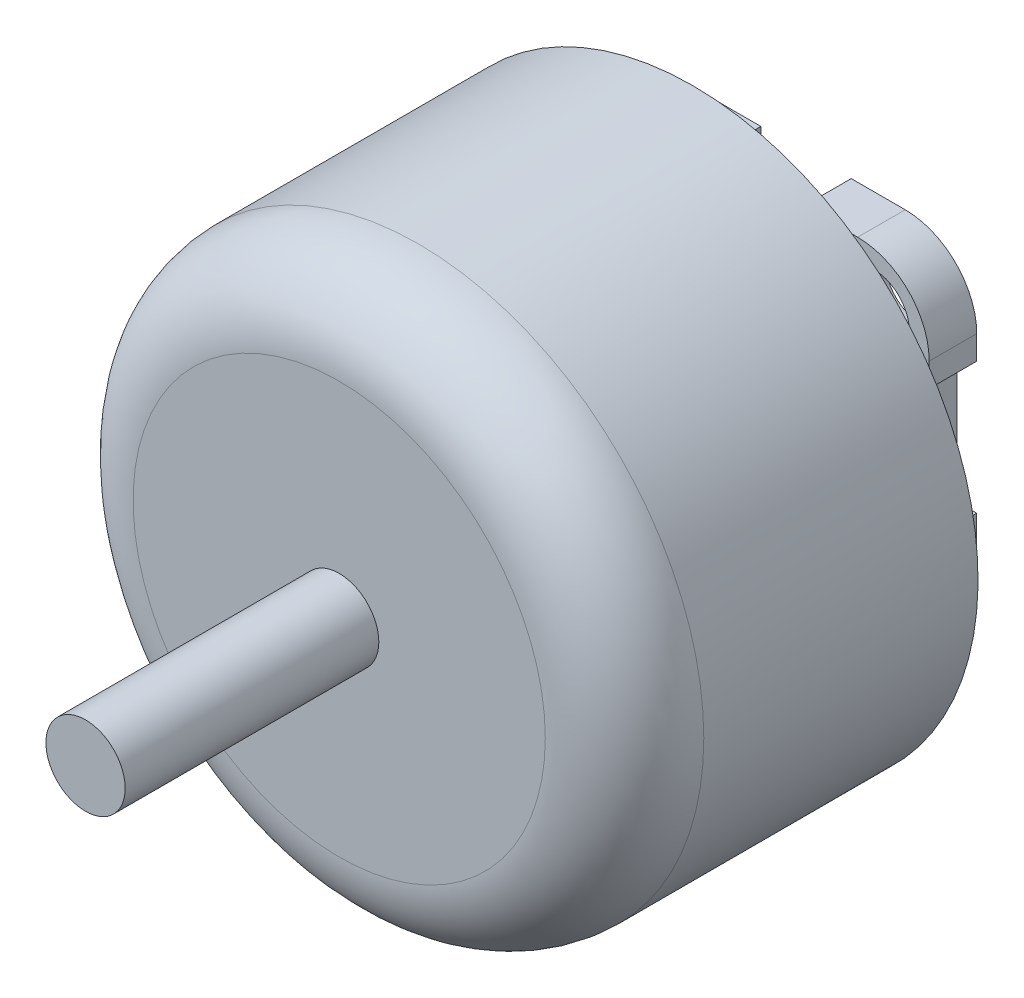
ISO-10303-21;
HEADER;
FILE_DESCRIPTION(('STEP AP214'),'2;1');
FILE_NAME('part.step','',(''),(''),'','','');
FILE_SCHEMA(('AUTOMOTIVE_DESIGN { 1 0 10303 214 1 1 1 1 }'));
ENDSEC;
DATA;
#1=APPLICATION_CONTEXT('core data for automotive mechanical design processes');
#2=APPLICATION_PROTOCOL_DEFINITION('international standard','automotive_design',2000,#1);
#3=PRODUCT_CONTEXT('',#1,'mechanical');
#4=PRODUCT('Part','Part','',(#3));
#5=PRODUCT_RELATED_PRODUCT_CATEGORY('part','',(#4));
#6=PRODUCT_DEFINITION_FORMATION('','',#4);
#7=PRODUCT_DEFINITION_CONTEXT('part definition',#1,'design');
#8=PRODUCT_DEFINITION('design','',#6,#7);
#9=PRODUCT_DEFINITION_SHAPE('','',#8);
#10=(LENGTH_UNIT() NAMED_UNIT(*) SI_UNIT(.MILLI.,.METRE.));
#11=(NAMED_UNIT(*) PLANE_ANGLE_UNIT() SI_UNIT($,.RADIAN.));
#12=(NAMED_UNIT(*) SI_UNIT($,.STERADIAN.) SOLID_ANGLE_UNIT());
#13=UNCERTAINTY_MEASURE_WITH_UNIT(LENGTH_MEASURE(1.E-05),#10,'distance_accuracy_value','');
#14=(GEOMETRIC_REPRESENTATION_CONTEXT(3) GLOBAL_UNCERTAINTY_ASSIGNED_CONTEXT((#13)) GLOBAL_UNIT_ASSIGNED_CONTEXT((#10,
#11,#12)) REPRESENTATION_CONTEXT('',''));
#15=CARTESIAN_POINT('',(0.,0.,0.));
#16=DIRECTION('',(0.,0.,1.));
#17=DIRECTION('',(1.,0.,0.));
#18=AXIS2_PLACEMENT_3D('',#15,#16,#17);
#19=CARTESIAN_POINT('',(-4.44128710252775,-5.14128710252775,0.));
#20=DIRECTION('',(0.,0.,-1.));
#21=DIRECTION('',(0.,-1.,0.));
#22=AXIS2_PLACEMENT_3D('',#19,#20,#21);
#23=PLANE('',#22);
#24=CARTESIAN_POINT('',(8.5175144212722,7.8175144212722,0.));
#25=DIRECTION('',(0.,0.,-1.));
#26=DIRECTION('',(1.,0.,0.));
#27=AXIS2_PLACEMENT_3D('',#24,#25,#26);
#28=CIRCLE('',#27,2.25);
#29=CARTESIAN_POINT('',(10.7675144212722,7.8175144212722,0.));
#30=VERTEX_POINT('',#29);
#31=EDGE_CURVE('P0_E11',#30,#30,#28,.T.);
#32=ORIENTED_EDGE('',*,*,#31,.F.);
#33=EDGE_LOOP('',(#32));
#34=FACE_BOUND('',#33,.T.);
#35=CARTESIAN_POINT('',(-4.9175144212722,7.8175144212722,0.));
#36=DIRECTION('',(0.,0.,-1.));
#37=DIRECTION('',(1.,0.,0.));
#38=AXIS2_PLACEMENT_3D('',#35,#36,#37);
#39=CIRCLE('',#38,2.25);
#40=CARTESIAN_POINT('',(-2.6675144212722,7.8175144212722,0.));
#41=VERTEX_POINT('',#40);
#42=EDGE_CURVE('P0_E307',#41,#41,#39,.T.);
#43=ORIENTED_EDGE('',*,*,#42,.F.);
#44=EDGE_LOOP('',(#43));
#45=FACE_BOUND('',#44,.T.);
#46=CARTESIAN_POINT('',(-4.9175144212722,-5.6175144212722,0.));
#47=DIRECTION('',(0.,0.,-1.));
#48=DIRECTION('',(1.,0.,0.));
#49=AXIS2_PLACEMENT_3D('',#46,#47,#48);
#50=CIRCLE('',#49,2.25);
#51=CARTESIAN_POINT('',(-2.6675144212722,-5.6175144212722,0.));
#52=VERTEX_POINT('',#51);
#53=EDGE_CURVE('P0_E374',#52,#52,#50,.T.);
#54=ORIENTED_EDGE('',*,*,#53,.F.);
#55=EDGE_LOOP('',(#54));
#56=FACE_BOUND('',#55,.T.);
#57=CARTESIAN_POINT('',(8.5175144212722,-5.6175144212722,0.));
#58=DIRECTION('',(0.,0.,-1.));
#59=DIRECTION('',(1.,0.,0.));
#60=AXIS2_PLACEMENT_3D('',#57,#58,#59);
#61=CIRCLE('',#60,2.25);
#62=CARTESIAN_POINT('',(10.7675144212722,-5.6175144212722,0.));
#63=VERTEX_POINT('',#62);
#64=EDGE_CURVE('P0_E384',#63,#63,#61,.T.);
#65=ORIENTED_EDGE('',*,*,#64,.F.);
#66=EDGE_LOOP('',(#65));
#67=FACE_BOUND('',#66,.T.);
#68=CARTESIAN_POINT('',(-4.44128710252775,-5.14128710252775,0.));
#69=DIRECTION('',(0.,0.,-1.));
#70=DIRECTION('',(1.,0.,0.));
#71=AXIS2_PLACEMENT_3D('',#68,#69,#70);
#72=CIRCLE('',#71,3.97622731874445);
#73=CARTESIAN_POINT('',(-4.44128710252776,-9.1175144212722,0.));
#74=VERTEX_POINT('',#73);
#75=CARTESIAN_POINT('',(-8.4175144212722,-5.14128710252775,0.));
#76=VERTEX_POINT('',#75);
#77=EDGE_CURVE('P0_E269',#74,#76,#72,.T.);
#78=ORIENTED_EDGE('',*,*,#77,.T.);
#79=DIRECTION('',(0.,1.,0.));
#80=VECTOR('',#79,1.);
#81=CARTESIAN_POINT('',(-8.4175144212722,-5.14128710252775,0.));
#82=LINE('',#81,#80);
#83=CARTESIAN_POINT('',(-8.4175144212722,-1.77018187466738,0.));
#84=VERTEX_POINT('',#83);
#85=EDGE_CURVE('P0_E324',#76,#84,#82,.T.);
#86=ORIENTED_EDGE('',*,*,#85,.T.);
#87=DIRECTION('',(1.,0.,0.));
#88=VECTOR('',#87,1.);
#89=CARTESIAN_POINT('',(-8.4175144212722,-1.77018187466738,0.));
#90=LINE('',#89,#88);
#91=CARTESIAN_POINT('',(-7.82327597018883,-1.77018187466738,0.));
#92=VERTEX_POINT('',#91);
#93=EDGE_CURVE('P0_E521',#84,#92,#90,.T.);
#94=ORIENTED_EDGE('',*,*,#93,.T.);
#95=CARTESIAN_POINT('',(-7.82327597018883,-0.446905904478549,0.));
#96=DIRECTION('',(0.,0.,1.));
#97=DIRECTION('',(1.,0.,0.));
#98=AXIS2_PLACEMENT_3D('',#95,#96,#97);
#99=CIRCLE('',#98,1.32327597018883);
#100=CARTESIAN_POINT('',(-6.5,-0.446905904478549,0.));
#101=VERTEX_POINT('',#100);
#102=EDGE_CURVE('P0_E249',#92,#101,#99,.T.);
#103=ORIENTED_EDGE('',*,*,#102,.T.);
#104=DIRECTION('',(0.,1.,0.));
#105=VECTOR('',#104,1.);
#106=CARTESIAN_POINT('',(-6.5,-0.446905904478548,0.));
#107=LINE('',#106,#105);
#108=CARTESIAN_POINT('',(-6.5,4.24920629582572,0.));
#109=VERTEX_POINT('',#108);
#110=EDGE_CURVE('P0_E233',#101,#109,#107,.T.);
#111=ORIENTED_EDGE('',*,*,#110,.T.);
#112=CARTESIAN_POINT('',(-7.81830812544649,4.24920629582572,0.));
#113=DIRECTION('',(0.,0.,1.));
#114=DIRECTION('',(1.,0.,0.));
#115=AXIS2_PLACEMENT_3D('',#112,#113,#114);
#116=CIRCLE('',#115,1.31830812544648);
#117=CARTESIAN_POINT('',(-7.81830812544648,5.5675144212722,0.));
#118=VERTEX_POINT('',#117);
#119=EDGE_CURVE('P0_E299',#109,#118,#116,.T.);
#120=ORIENTED_EDGE('',*,*,#119,.T.);
#121=DIRECTION('',(-1.,0.,0.));
#122=VECTOR('',#121,1.);
#123=CARTESIAN_POINT('',(-7.81830812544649,5.5675144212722,0.));
#124=LINE('',#123,#122);
#125=CARTESIAN_POINT('',(-8.4175144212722,5.5675144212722,0.));
#126=VERTEX_POINT('',#125);
#127=EDGE_CURVE('P0_E414',#118,#126,#124,.T.);
#128=ORIENTED_EDGE('',*,*,#127,.T.);
#129=DIRECTION('',(0.,1.,0.));
#130=VECTOR('',#129,1.);
#131=CARTESIAN_POINT('',(-8.4175144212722,5.5675144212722,0.));
#132=LINE('',#131,#130);
#133=CARTESIAN_POINT('',(-8.4175144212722,7.13664056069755,0.));
#134=VERTEX_POINT('',#133);
#135=EDGE_CURVE('P0_E363',#126,#134,#132,.T.);
#136=ORIENTED_EDGE('',*,*,#135,.T.);
#137=CARTESIAN_POINT('',(-4.23664056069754,7.13664056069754,0.));
#138=DIRECTION('',(0.,0.,-1.));
#139=DIRECTION('',(1.,0.,0.));
#140=AXIS2_PLACEMENT_3D('',#137,#138,#139);
#141=CIRCLE('',#140,4.18087386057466);
#142=CARTESIAN_POINT('',(-4.23664056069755,11.3175144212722,0.));
#143=VERTEX_POINT('',#142);
#144=EDGE_CURVE('P0_E370',#134,#143,#141,.T.);
#145=ORIENTED_EDGE('',*,*,#144,.T.);
#146=DIRECTION('',(1.,0.,0.));
#147=VECTOR('',#146,1.);
#148=CARTESIAN_POINT('',(-4.23664056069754,11.3175144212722,0.));
#149=LINE('',#148,#147);
#150=CARTESIAN_POINT('',(-1.6,11.3175144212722,0.));
#151=VERTEX_POINT('',#150);
#152=EDGE_CURVE('P0_E348',#143,#151,#149,.T.);
#153=ORIENTED_EDGE('',*,*,#152,.T.);
#154=DIRECTION('',(0.,-1.,0.));
#155=VECTOR('',#154,1.);
#156=CARTESIAN_POINT('',(-1.6,11.3175144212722,0.));
#157=LINE('',#156,#155);
#158=CARTESIAN_POINT('',(-1.6,10.2220664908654,0.));
#159=VERTEX_POINT('',#158);
#160=EDGE_CURVE('P0_E483',#151,#159,#157,.T.);
#161=ORIENTED_EDGE('',*,*,#160,.T.);
#162=CARTESIAN_POINT('',(-0.677933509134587,10.2220664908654,0.));
#163=DIRECTION('',(0.,0.,1.));
#164=DIRECTION('',(1.,0.,0.));
#165=AXIS2_PLACEMENT_3D('',#162,#163,#164);
#166=CIRCLE('',#165,0.922066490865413);
#167=CARTESIAN_POINT('',(-0.677933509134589,9.3,0.));
#168=VERTEX_POINT('',#167);
#169=EDGE_CURVE('P0_E445',#159,#168,#166,.T.);
#170=ORIENTED_EDGE('',*,*,#169,.T.);
#171=DIRECTION('',(1.,0.,0.));
#172=VECTOR('',#171,1.);
#173=CARTESIAN_POINT('',(-0.677933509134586,9.3,0.));
#174=LINE('',#173,#172);
#175=CARTESIAN_POINT('',(3.1936742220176,9.3,0.));
#176=VERTEX_POINT('',#175);
#177=EDGE_CURVE('P0_E314',#168,#176,#174,.T.);
#178=ORIENTED_EDGE('',*,*,#177,.T.);
#179=CARTESIAN_POINT('',(3.1936742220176,10.2063257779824,0.));
#180=DIRECTION('',(0.,0.,1.));
#181=DIRECTION('',(1.,0.,0.));
#182=AXIS2_PLACEMENT_3D('',#179,#180,#181);
#183=CIRCLE('',#182,0.906325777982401);
#184=CARTESIAN_POINT('',(4.1,10.2063257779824,0.));
#185=VERTEX_POINT('',#184);
#186=EDGE_CURVE('P0_E475',#176,#185,#183,.T.);
#187=ORIENTED_EDGE('',*,*,#186,.T.);
#188=DIRECTION('',(0.,1.,0.));
#189=VECTOR('',#188,1.);
#190=CARTESIAN_POINT('',(4.1,10.2063257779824,0.));
#191=LINE('',#190,#189);
#192=CARTESIAN_POINT('',(4.1,11.3175144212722,0.));
#193=VERTEX_POINT('',#192);
#194=EDGE_CURVE('P0_E342',#185,#193,#191,.T.);
#195=ORIENTED_EDGE('',*,*,#194,.T.);
#196=DIRECTION('',(1.,0.,0.));
#197=VECTOR('',#196,1.);
#198=CARTESIAN_POINT('',(4.1,11.3175144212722,0.));
#199=LINE('',#198,#197);
#200=CARTESIAN_POINT('',(7.50407934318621,11.3175144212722,0.));
#201=VERTEX_POINT('',#200);
#202=EDGE_CURVE('P0_E325',#193,#201,#199,.T.);
#203=ORIENTED_EDGE('',*,*,#202,.T.);
#204=CARTESIAN_POINT('',(7.50407934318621,6.80407934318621,0.));
#205=DIRECTION('',(0.,0.,-1.));
#206=DIRECTION('',(1.,0.,0.));
#207=AXIS2_PLACEMENT_3D('',#204,#205,#206);
#208=CIRCLE('',#207,4.51343507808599);
#209=CARTESIAN_POINT('',(12.0175144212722,6.80407934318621,0.));
#210=VERTEX_POINT('',#209);
#211=EDGE_CURVE('P0_E352',#201,#210,#208,.T.);
#212=ORIENTED_EDGE('',*,*,#211,.T.);
#213=DIRECTION('',(0.,-1.,0.));
#214=VECTOR('',#213,1.);
#215=CARTESIAN_POINT('',(12.0175144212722,6.80407934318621,0.));
#216=LINE('',#215,#214);
#217=CARTESIAN_POINT('',(12.0175144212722,5.3,0.));
#218=VERTEX_POINT('',#217);
#219=EDGE_CURVE('P0_E297',#210,#218,#216,.T.);
#220=ORIENTED_EDGE('',*,*,#219,.T.);
#221=DIRECTION('',(-1.,0.,0.));
#222=VECTOR('',#221,1.);
#223=CARTESIAN_POINT('',(12.0175144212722,5.3,0.));
#224=LINE('',#223,#222);
#225=CARTESIAN_POINT('',(11.6784730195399,5.3,0.));
#226=VERTEX_POINT('',#225);
#227=EDGE_CURVE('P0_E572',#218,#226,#224,.T.);
#228=ORIENTED_EDGE('',*,*,#227,.T.);
#229=CARTESIAN_POINT('',(11.6784730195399,4.38904140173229,0.));
#230=DIRECTION('',(0.,0.,1.));
#231=DIRECTION('',(1.,0.,0.));
#232=AXIS2_PLACEMENT_3D('',#229,#230,#231);
#233=CIRCLE('',#232,0.910958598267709);
#234=CARTESIAN_POINT('',(10.7675144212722,4.3890414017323,0.));
#235=VERTEX_POINT('',#234);
#236=EDGE_CURVE('P0_E288',#226,#235,#233,.T.);
#237=ORIENTED_EDGE('',*,*,#236,.T.);
#238=DIRECTION('',(0.,-1.,0.));
#239=VECTOR('',#238,1.);
#240=CARTESIAN_POINT('',(10.7675144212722,4.3890414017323,0.));
#241=LINE('',#240,#239);
#242=CARTESIAN_POINT('',(10.7675144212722,-2.01027525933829,0.));
#243=VERTEX_POINT('',#242);
#244=EDGE_CURVE('P0_E579',#235,#243,#241,.T.);
#245=ORIENTED_EDGE('',*,*,#244,.T.);
#246=CARTESIAN_POINT('',(11.7572391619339,-2.01027525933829,0.));
#247=DIRECTION('',(0.,0.,1.));
#248=DIRECTION('',(1.,0.,0.));
#249=AXIS2_PLACEMENT_3D('',#246,#247,#248);
#250=CIRCLE('',#249,0.989724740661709);
#251=CARTESIAN_POINT('',(11.7572391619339,-3.,0.));
#252=VERTEX_POINT('',#251);
#253=EDGE_CURVE('P0_E404',#243,#252,#250,.T.);
#254=ORIENTED_EDGE('',*,*,#253,.T.);
#255=DIRECTION('',(1.,0.,0.));
#256=VECTOR('',#255,1.);
#257=CARTESIAN_POINT('',(11.7572391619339,-3.,0.));
#258=LINE('',#257,#256);
#259=CARTESIAN_POINT('',(12.0175144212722,-3.,0.));
#260=VERTEX_POINT('',#259);
#261=EDGE_CURVE('P0_E358',#252,#260,#258,.T.);
#262=ORIENTED_EDGE('',*,*,#261,.T.);
#263=DIRECTION('',(0.,-1.,0.));
#264=VECTOR('',#263,1.);
#265=CARTESIAN_POINT('',(12.0175144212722,-3.,0.));
#266=LINE('',#265,#264);
#267=CARTESIAN_POINT('',(12.0175144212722,-4.46844821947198,0.));
#268=VERTEX_POINT('',#267);
#269=EDGE_CURVE('P0_E492',#260,#268,#266,.T.);
#270=ORIENTED_EDGE('',*,*,#269,.T.);
#271=CARTESIAN_POINT('',(7.36844821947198,-4.46844821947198,0.));
#272=DIRECTION('',(0.,0.,-1.));
#273=DIRECTION('',(1.,0.,0.));
#274=AXIS2_PLACEMENT_3D('',#271,#272,#273);
#275=CIRCLE('',#274,4.64906620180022);
#276=CARTESIAN_POINT('',(7.36844821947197,-9.1175144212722,0.));
#277=VERTEX_POINT('',#276);
#278=EDGE_CURVE('P0_E496',#268,#277,#275,.T.);
#279=ORIENTED_EDGE('',*,*,#278,.T.);
#280=DIRECTION('',(-1.,0.,0.));
#281=VECTOR('',#280,1.);
#282=CARTESIAN_POINT('',(7.36844821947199,-9.1175144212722,0.));
#283=LINE('',#282,#281);
#284=CARTESIAN_POINT('',(5.,-9.1175144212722,0.));
#285=VERTEX_POINT('',#284);
#286=EDGE_CURVE('P0_E260',#277,#285,#283,.T.);
#287=ORIENTED_EDGE('',*,*,#286,.T.);
#288=DIRECTION('',(0.,1.,0.));
#289=VECTOR('',#288,1.);
#290=CARTESIAN_POINT('',(5.,-9.1175144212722,0.));
#291=LINE('',#290,#289);
#292=CARTESIAN_POINT('',(5.,-7.93109467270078,0.));
#293=VERTEX_POINT('',#292);
#294=EDGE_CURVE('P0_E451',#285,#293,#291,.T.);
#295=ORIENTED_EDGE('',*,*,#294,.T.);
#296=CARTESIAN_POINT('',(4.06890532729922,-7.93109467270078,0.));
#297=DIRECTION('',(0.,0.,1.));
#298=DIRECTION('',(1.,0.,0.));
#299=AXIS2_PLACEMENT_3D('',#296,#297,#298);
#300=CIRCLE('',#299,0.931094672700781);
#301=CARTESIAN_POINT('',(4.06890532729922,-7.,0.));
#302=VERTEX_POINT('',#301);
#303=EDGE_CURVE('P0_E278',#293,#302,#300,.T.);
#304=ORIENTED_EDGE('',*,*,#303,.T.);
#305=DIRECTION('',(-1.,0.,0.));
#306=VECTOR('',#305,1.);
#307=CARTESIAN_POINT('',(4.06890532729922,-7.,0.));
#308=LINE('',#307,#306);
#309=CARTESIAN_POINT('',(-0.459680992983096,-7.,0.));
#310=VERTEX_POINT('',#309);
#311=EDGE_CURVE('P0_E166',#302,#310,#308,.T.);
#312=ORIENTED_EDGE('',*,*,#311,.T.);
#313=CARTESIAN_POINT('',(-0.459680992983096,-8.0403190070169,0.));
#314=DIRECTION('',(0.,0.,1.));
#315=DIRECTION('',(1.,0.,0.));
#316=AXIS2_PLACEMENT_3D('',#313,#314,#315);
#317=CIRCLE('',#316,1.0403190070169);
#318=CARTESIAN_POINT('',(-1.5,-8.0403190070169,0.));
#319=VERTEX_POINT('',#318);
#320=EDGE_CURVE('P0_E467',#310,#319,#317,.T.);
#321=ORIENTED_EDGE('',*,*,#320,.T.);
#322=DIRECTION('',(0.,-1.,0.));
#323=VECTOR('',#322,1.);
#324=CARTESIAN_POINT('',(-1.5,-8.0403190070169,0.));
#325=LINE('',#324,#323);
#326=CARTESIAN_POINT('',(-1.5,-9.1175144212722,0.));
#327=VERTEX_POINT('',#326);
#328=EDGE_CURVE('P0_E313',#319,#327,#325,.T.);
#329=ORIENTED_EDGE('',*,*,#328,.T.);
#330=DIRECTION('',(-1.,0.,0.));
#331=VECTOR('',#330,1.);
#332=CARTESIAN_POINT('',(-1.5,-9.1175144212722,0.));
#333=LINE('',#332,#331);
#334=EDGE_CURVE('P0_E21',#327,#74,#333,.T.);
#335=ORIENTED_EDGE('',*,*,#334,.T.);
#336=EDGE_LOOP('',(#78,#86,#94,#103,#111,#120,#128,#136,#145,#153,#161,#170,#178,#187,#195,#203,
#212,#220,#228,#237,#245,#254,#262,#270,#279,#287,#295,#304,#312,#321,#329,#335));
#337=FACE_BOUND('',#336,.T.);
#338=ADVANCED_FACE('P0_F17',(#34,#45,#56,#67,#337),#23,.T.);
#339=CARTESIAN_POINT('',(-4.44128710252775,-5.14128710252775,3.));
#340=DIRECTION('',(0.,0.,-1.));
#341=DIRECTION('',(0.,-1.,0.));
#342=AXIS2_PLACEMENT_3D('',#339,#340,#341);
#343=PLANE('',#342);
#344=CARTESIAN_POINT('',(8.5175144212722,7.8175144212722,3.));
#345=DIRECTION('',(0.,0.,-1.));
#346=DIRECTION('',(1.,0.,0.));
#347=AXIS2_PLACEMENT_3D('',#344,#345,#346);
#348=CIRCLE('',#347,2.25);
#349=CARTESIAN_POINT('',(10.7675144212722,7.8175144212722,3.));
#350=VERTEX_POINT('',#349);
#351=EDGE_CURVE('P0_E28',#350,#350,#348,.T.);
#352=ORIENTED_EDGE('',*,*,#351,.T.);
#353=EDGE_LOOP('',(#352));
#354=FACE_BOUND('',#353,.T.);
#355=CARTESIAN_POINT('',(-4.9175144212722,7.8175144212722,3.));
#356=DIRECTION('',(0.,0.,-1.));
#357=DIRECTION('',(1.,0.,0.));
#358=AXIS2_PLACEMENT_3D('',#355,#356,#357);
#359=CIRCLE('',#358,2.25);
#360=CARTESIAN_POINT('',(-2.6675144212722,7.8175144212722,3.));
#361=VERTEX_POINT('',#360);
#362=EDGE_CURVE('P0_E303',#361,#361,#359,.T.);
#363=ORIENTED_EDGE('',*,*,#362,.T.);
#364=EDGE_LOOP('',(#363));
#365=FACE_BOUND('',#364,.T.);
#366=CARTESIAN_POINT('',(-4.9175144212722,-5.6175144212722,3.));
#367=DIRECTION('',(0.,0.,-1.));
#368=DIRECTION('',(1.,0.,0.));
#369=AXIS2_PLACEMENT_3D('',#366,#367,#368);
#370=CIRCLE('',#369,2.25);
#371=CARTESIAN_POINT('',(-2.6675144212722,-5.6175144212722,3.));
#372=VERTEX_POINT('',#371);
#373=EDGE_CURVE('P0_E377',#372,#372,#370,.T.);
#374=ORIENTED_EDGE('',*,*,#373,.T.);
#375=EDGE_LOOP('',(#374));
#376=FACE_BOUND('',#375,.T.);
#377=CARTESIAN_POINT('',(8.5175144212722,-5.6175144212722,3.));
#378=DIRECTION('',(0.,0.,-1.));
#379=DIRECTION('',(1.,0.,0.));
#380=AXIS2_PLACEMENT_3D('',#377,#378,#379);
#381=CIRCLE('',#380,2.25);
#382=CARTESIAN_POINT('',(10.7675144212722,-5.6175144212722,3.));
#383=VERTEX_POINT('',#382);
#384=EDGE_CURVE('P0_E376',#383,#383,#381,.T.);
#385=ORIENTED_EDGE('',*,*,#384,.T.);
#386=EDGE_LOOP('',(#385));
#387=FACE_BOUND('',#386,.T.);
#388=CARTESIAN_POINT('',(-4.44128710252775,-5.14128710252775,3.));
#389=DIRECTION('',(0.,0.,-1.));
#390=DIRECTION('',(1.,0.,0.));
#391=AXIS2_PLACEMENT_3D('',#388,#389,#390);
#392=CIRCLE('',#391,3.97622731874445);
#393=CARTESIAN_POINT('',(-4.44128710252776,-9.1175144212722,3.));
#394=VERTEX_POINT('',#393);
#395=CARTESIAN_POINT('',(-8.4175144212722,-5.14128710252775,3.));
#396=VERTEX_POINT('',#395);
#397=EDGE_CURVE('P0_E292',#394,#396,#392,.T.);
#398=ORIENTED_EDGE('',*,*,#397,.F.);
#399=DIRECTION('',(-1.,0.,0.));
#400=VECTOR('',#399,1.);
#401=CARTESIAN_POINT('',(-1.5,-9.1175144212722,3.));
#402=LINE('',#401,#400);
#403=CARTESIAN_POINT('',(-1.5,-9.1175144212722,3.));
#404=VERTEX_POINT('',#403);
#405=EDGE_CURVE('P0_E332',#404,#394,#402,.T.);
#406=ORIENTED_EDGE('',*,*,#405,.F.);
#407=DIRECTION('',(0.,-1.,0.));
#408=VECTOR('',#407,1.);
#409=CARTESIAN_POINT('',(-1.5,-8.0403190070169,3.));
#410=LINE('',#409,#408);
#411=CARTESIAN_POINT('',(-1.5,-8.0403190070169,3.));
#412=VERTEX_POINT('',#411);
#413=EDGE_CURVE('P0_E309',#412,#404,#410,.T.);
#414=ORIENTED_EDGE('',*,*,#413,.F.);
#415=CARTESIAN_POINT('',(-0.459680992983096,-8.0403190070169,3.));
#416=DIRECTION('',(0.,0.,1.));
#417=DIRECTION('',(1.,0.,0.));
#418=AXIS2_PLACEMENT_3D('',#415,#416,#417);
#419=CIRCLE('',#418,1.0403190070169);
#420=CARTESIAN_POINT('',(-0.459680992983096,-7.,3.));
#421=VERTEX_POINT('',#420);
#422=EDGE_CURVE('P0_E432',#421,#412,#419,.T.);
#423=ORIENTED_EDGE('',*,*,#422,.F.);
#424=DIRECTION('',(-1.,0.,0.));
#425=VECTOR('',#424,1.);
#426=CARTESIAN_POINT('',(4.06890532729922,-7.,3.));
#427=LINE('',#426,#425);
#428=CARTESIAN_POINT('',(4.06890532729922,-7.,3.));
#429=VERTEX_POINT('',#428);
#430=EDGE_CURVE('P0_E177',#429,#421,#427,.T.);
#431=ORIENTED_EDGE('',*,*,#430,.F.);
#432=CARTESIAN_POINT('',(4.06890532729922,-7.93109467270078,3.));
#433=DIRECTION('',(0.,0.,1.));
#434=DIRECTION('',(1.,0.,0.));
#435=AXIS2_PLACEMENT_3D('',#432,#433,#434);
#436=CIRCLE('',#435,0.931094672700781);
#437=CARTESIAN_POINT('',(5.,-7.93109467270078,3.));
#438=VERTEX_POINT('',#437);
#439=EDGE_CURVE('P0_E282',#438,#429,#436,.T.);
#440=ORIENTED_EDGE('',*,*,#439,.F.);
#441=DIRECTION('',(0.,1.,0.));
#442=VECTOR('',#441,1.);
#443=CARTESIAN_POINT('',(5.,-9.1175144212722,3.));
#444=LINE('',#443,#442);
#445=CARTESIAN_POINT('',(5.,-9.1175144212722,3.));
#446=VERTEX_POINT('',#445);
#447=EDGE_CURVE('P0_E258',#446,#438,#444,.T.);
#448=ORIENTED_EDGE('',*,*,#447,.F.);
#449=DIRECTION('',(-1.,0.,0.));
#450=VECTOR('',#449,1.);
#451=CARTESIAN_POINT('',(7.36844821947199,-9.1175144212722,3.));
#452=LINE('',#451,#450);
#453=CARTESIAN_POINT('',(7.36844821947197,-9.1175144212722,3.));
#454=VERTEX_POINT('',#453);
#455=EDGE_CURVE('P0_E263',#454,#446,#452,.T.);
#456=ORIENTED_EDGE('',*,*,#455,.F.);
#457=CARTESIAN_POINT('',(7.36844821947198,-4.46844821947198,3.));
#458=DIRECTION('',(0.,0.,-1.));
#459=DIRECTION('',(1.,0.,0.));
#460=AXIS2_PLACEMENT_3D('',#457,#458,#459);
#461=CIRCLE('',#460,4.64906620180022);
#462=CARTESIAN_POINT('',(12.0175144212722,-4.46844821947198,3.));
#463=VERTEX_POINT('',#462);
#464=EDGE_CURVE('P0_E268',#463,#454,#461,.T.);
#465=ORIENTED_EDGE('',*,*,#464,.F.);
#466=DIRECTION('',(0.,-1.,0.));
#467=VECTOR('',#466,1.);
#468=CARTESIAN_POINT('',(12.0175144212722,-3.,3.));
#469=LINE('',#468,#467);
#470=CARTESIAN_POINT('',(12.0175144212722,-3.,3.));
#471=VERTEX_POINT('',#470);
#472=EDGE_CURVE('P0_E596',#471,#463,#469,.T.);
#473=ORIENTED_EDGE('',*,*,#472,.F.);
#474=DIRECTION('',(1.,0.,0.));
#475=VECTOR('',#474,1.);
#476=CARTESIAN_POINT('',(11.7572391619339,-3.,3.));
#477=LINE('',#476,#475);
#478=CARTESIAN_POINT('',(11.7572391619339,-3.,3.));
#479=VERTEX_POINT('',#478);
#480=EDGE_CURVE('P0_E353',#479,#471,#477,.T.);
#481=ORIENTED_EDGE('',*,*,#480,.F.);
#482=CARTESIAN_POINT('',(11.7572391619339,-2.01027525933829,3.));
#483=DIRECTION('',(0.,0.,1.));
#484=DIRECTION('',(1.,0.,0.));
#485=AXIS2_PLACEMENT_3D('',#482,#483,#484);
#486=CIRCLE('',#485,0.989724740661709);
#487=CARTESIAN_POINT('',(10.7675144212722,-2.01027525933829,3.));
#488=VERTEX_POINT('',#487);
#489=EDGE_CURVE('P0_E436',#488,#479,#486,.T.);
#490=ORIENTED_EDGE('',*,*,#489,.F.);
#491=DIRECTION('',(0.,-1.,0.));
#492=VECTOR('',#491,1.);
#493=CARTESIAN_POINT('',(10.7675144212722,4.3890414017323,3.));
#494=LINE('',#493,#492);
#495=CARTESIAN_POINT('',(10.7675144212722,4.3890414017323,3.));
#496=VERTEX_POINT('',#495);
#497=EDGE_CURVE('P0_E405',#496,#488,#494,.T.);
#498=ORIENTED_EDGE('',*,*,#497,.F.);
#499=CARTESIAN_POINT('',(11.6784730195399,4.38904140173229,3.));
#500=DIRECTION('',(0.,0.,1.));
#501=DIRECTION('',(1.,0.,0.));
#502=AXIS2_PLACEMENT_3D('',#499,#500,#501);
#503=CIRCLE('',#502,0.910958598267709);
#504=CARTESIAN_POINT('',(11.6784730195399,5.3,3.));
#505=VERTEX_POINT('',#504);
#506=EDGE_CURVE('P0_E283',#505,#496,#503,.T.);
#507=ORIENTED_EDGE('',*,*,#506,.F.);
#508=DIRECTION('',(-1.,0.,0.));
#509=VECTOR('',#508,1.);
#510=CARTESIAN_POINT('',(12.0175144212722,5.3,3.));
#511=LINE('',#510,#509);
#512=CARTESIAN_POINT('',(12.0175144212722,5.3,3.));
#513=VERTEX_POINT('',#512);
#514=EDGE_CURVE('P0_E568',#513,#505,#511,.T.);
#515=ORIENTED_EDGE('',*,*,#514,.F.);
#516=DIRECTION('',(0.,-1.,0.));
#517=VECTOR('',#516,1.);
#518=CARTESIAN_POINT('',(12.0175144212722,6.80407934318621,3.));
#519=LINE('',#518,#517);
#520=CARTESIAN_POINT('',(12.0175144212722,6.80407934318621,3.));
#521=VERTEX_POINT('',#520);
#522=EDGE_CURVE('P0_E419',#521,#513,#519,.T.);
#523=ORIENTED_EDGE('',*,*,#522,.F.);
#524=CARTESIAN_POINT('',(7.50407934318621,6.80407934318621,3.));
#525=DIRECTION('',(0.,0.,-1.));
#526=DIRECTION('',(1.,0.,0.));
#527=AXIS2_PLACEMENT_3D('',#524,#525,#526);
#528=CIRCLE('',#527,4.51343507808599);
#529=CARTESIAN_POINT('',(7.50407934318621,11.3175144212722,3.));
#530=VERTEX_POINT('',#529);
#531=EDGE_CURVE('P0_E298',#530,#521,#528,.T.);
#532=ORIENTED_EDGE('',*,*,#531,.F.);
#533=DIRECTION('',(1.,0.,0.));
#534=VECTOR('',#533,1.);
#535=CARTESIAN_POINT('',(4.1,11.3175144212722,3.));
#536=LINE('',#535,#534);
#537=CARTESIAN_POINT('',(4.1,11.3175144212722,3.));
#538=VERTEX_POINT('',#537);
#539=EDGE_CURVE('P0_E329',#538,#530,#536,.T.);
#540=ORIENTED_EDGE('',*,*,#539,.F.);
#541=DIRECTION('',(0.,1.,0.));
#542=VECTOR('',#541,1.);
#543=CARTESIAN_POINT('',(4.1,10.2063257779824,3.));
#544=LINE('',#543,#542);
#545=CARTESIAN_POINT('',(4.1,10.2063257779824,3.));
#546=VERTEX_POINT('',#545);
#547=EDGE_CURVE('P0_E338',#546,#538,#544,.T.);
#548=ORIENTED_EDGE('',*,*,#547,.F.);
#549=CARTESIAN_POINT('',(3.1936742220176,10.2063257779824,3.));
#550=DIRECTION('',(0.,0.,1.));
#551=DIRECTION('',(1.,0.,0.));
#552=AXIS2_PLACEMENT_3D('',#549,#550,#551);
#553=CIRCLE('',#552,0.906325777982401);
#554=CARTESIAN_POINT('',(3.1936742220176,9.3,3.));
#555=VERTEX_POINT('',#554);
#556=EDGE_CURVE('P0_E550',#555,#546,#553,.T.);
#557=ORIENTED_EDGE('',*,*,#556,.F.);
#558=DIRECTION('',(1.,0.,0.));
#559=VECTOR('',#558,1.);
#560=CARTESIAN_POINT('',(-0.677933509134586,9.3,3.));
#561=LINE('',#560,#559);
#562=CARTESIAN_POINT('',(-0.677933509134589,9.3,3.));
#563=VERTEX_POINT('',#562);
#564=EDGE_CURVE('P0_E318',#563,#555,#561,.T.);
#565=ORIENTED_EDGE('',*,*,#564,.F.);
#566=CARTESIAN_POINT('',(-0.677933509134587,10.2220664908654,3.));
#567=DIRECTION('',(0.,0.,1.));
#568=DIRECTION('',(1.,0.,0.));
#569=AXIS2_PLACEMENT_3D('',#566,#567,#568);
#570=CIRCLE('',#569,0.922066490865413);
#571=CARTESIAN_POINT('',(-1.6,10.2220664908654,3.));
#572=VERTEX_POINT('',#571);
#573=EDGE_CURVE('P0_E449',#572,#563,#570,.T.);
#574=ORIENTED_EDGE('',*,*,#573,.F.);
#575=DIRECTION('',(0.,-1.,0.));
#576=VECTOR('',#575,1.);
#577=CARTESIAN_POINT('',(-1.6,11.3175144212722,3.));
#578=LINE('',#577,#576);
#579=CARTESIAN_POINT('',(-1.6,11.3175144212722,3.));
#580=VERTEX_POINT('',#579);
#581=EDGE_CURVE('P0_E479',#580,#572,#578,.T.);
#582=ORIENTED_EDGE('',*,*,#581,.F.);
#583=DIRECTION('',(1.,0.,0.));
#584=VECTOR('',#583,1.);
#585=CARTESIAN_POINT('',(-4.23664056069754,11.3175144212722,3.));
#586=LINE('',#585,#584);
#587=CARTESIAN_POINT('',(-4.23664056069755,11.3175144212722,3.));
#588=VERTEX_POINT('',#587);
#589=EDGE_CURVE('P0_E343',#588,#580,#586,.T.);
#590=ORIENTED_EDGE('',*,*,#589,.F.);
#591=CARTESIAN_POINT('',(-4.23664056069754,7.13664056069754,3.));
#592=DIRECTION('',(0.,0.,-1.));
#593=DIRECTION('',(1.,0.,0.));
#594=AXIS2_PLACEMENT_3D('',#591,#592,#593);
#595=CIRCLE('',#594,4.18087386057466);
#596=CARTESIAN_POINT('',(-8.4175144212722,7.13664056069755,3.));
#597=VERTEX_POINT('',#596);
#598=EDGE_CURVE('P0_E365',#597,#588,#595,.T.);
#599=ORIENTED_EDGE('',*,*,#598,.F.);
#600=DIRECTION('',(0.,1.,0.));
#601=VECTOR('',#600,1.);
#602=CARTESIAN_POINT('',(-8.4175144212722,5.5675144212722,3.));
#603=LINE('',#602,#601);
#604=CARTESIAN_POINT('',(-8.4175144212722,5.5675144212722,3.));
#605=VERTEX_POINT('',#604);
#606=EDGE_CURVE('P0_E428',#605,#597,#603,.T.);
#607=ORIENTED_EDGE('',*,*,#606,.F.);
#608=DIRECTION('',(-1.,0.,0.));
#609=VECTOR('',#608,1.);
#610=CARTESIAN_POINT('',(-7.81830812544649,5.5675144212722,3.));
#611=LINE('',#610,#609);
#612=CARTESIAN_POINT('',(-7.81830812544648,5.5675144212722,3.));
#613=VERTEX_POINT('',#612);
#614=EDGE_CURVE('P0_E364',#613,#605,#611,.T.);
#615=ORIENTED_EDGE('',*,*,#614,.F.);
#616=CARTESIAN_POINT('',(-7.81830812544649,4.24920629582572,3.));
#617=DIRECTION('',(0.,0.,1.));
#618=DIRECTION('',(1.,0.,0.));
#619=AXIS2_PLACEMENT_3D('',#616,#617,#618);
#620=CIRCLE('',#619,1.31830812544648);
#621=CARTESIAN_POINT('',(-6.5,4.24920629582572,3.));
#622=VERTEX_POINT('',#621);
#623=EDGE_CURVE('P0_E227',#622,#613,#620,.T.);
#624=ORIENTED_EDGE('',*,*,#623,.F.);
#625=DIRECTION('',(0.,1.,0.));
#626=VECTOR('',#625,1.);
#627=CARTESIAN_POINT('',(-6.5,-0.446905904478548,3.));
#628=LINE('',#627,#626);
#629=CARTESIAN_POINT('',(-6.5,-0.446905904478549,3.));
#630=VERTEX_POINT('',#629);
#631=EDGE_CURVE('P0_E218',#630,#622,#628,.T.);
#632=ORIENTED_EDGE('',*,*,#631,.F.);
#633=CARTESIAN_POINT('',(-7.82327597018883,-0.446905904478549,3.));
#634=DIRECTION('',(0.,0.,1.));
#635=DIRECTION('',(1.,0.,0.));
#636=AXIS2_PLACEMENT_3D('',#633,#634,#635);
#637=CIRCLE('',#636,1.32327597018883);
#638=CARTESIAN_POINT('',(-7.82327597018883,-1.77018187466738,3.));
#639=VERTEX_POINT('',#638);
#640=EDGE_CURVE('P0_E224',#639,#630,#637,.T.);
#641=ORIENTED_EDGE('',*,*,#640,.F.);
#642=DIRECTION('',(1.,0.,0.));
#643=VECTOR('',#642,1.);
#644=CARTESIAN_POINT('',(-8.4175144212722,-1.77018187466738,3.));
#645=LINE('',#644,#643);
#646=CARTESIAN_POINT('',(-8.4175144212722,-1.77018187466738,3.));
#647=VERTEX_POINT('',#646);
#648=EDGE_CURVE('P0_E536',#647,#639,#645,.T.);
#649=ORIENTED_EDGE('',*,*,#648,.F.);
#650=DIRECTION('',(0.,1.,0.));
#651=VECTOR('',#650,1.);
#652=CARTESIAN_POINT('',(-8.4175144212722,-5.14128710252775,3.));
#653=LINE('',#652,#651);
#654=EDGE_CURVE('P0_E409',#396,#647,#653,.T.);
#655=ORIENTED_EDGE('',*,*,#654,.F.);
#656=EDGE_LOOP('',(#398,#406,#414,#423,#431,#440,#448,#456,#465,#473,#481,#490,#498,#507,#515,
#523,#532,#540,#548,#557,#565,#574,#582,#590,#599,#607,#615,#624,#632,#641,#649,#655));
#657=FACE_BOUND('',#656,.T.);
#658=ADVANCED_FACE('P0_F221',(#354,#365,#376,#387,#657),#343,.F.);
#659=CARTESIAN_POINT('',(8.5175144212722,7.8175144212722,3.));
#660=DIRECTION('',(0.,0.,-1.));
#661=DIRECTION('',(-1.,0.,0.));
#662=AXIS2_PLACEMENT_3D('',#659,#660,#661);
#663=CYLINDRICAL_SURFACE('',#662,2.25);
#664=ORIENTED_EDGE('',*,*,#31,.T.);
#665=EDGE_LOOP('',(#664));
#666=FACE_BOUND('',#665,.T.);
#667=ORIENTED_EDGE('',*,*,#351,.F.);
#668=EDGE_LOOP('',(#667));
#669=FACE_BOUND('',#668,.T.);
#670=ADVANCED_FACE('P0_F711',(#666,#669),#663,.F.);
#671=CARTESIAN_POINT('',(-1.5,-9.1175144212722,3.));
#672=DIRECTION('',(0.,-1.,0.));
#673=DIRECTION('',(0.,0.,-1.));
#674=AXIS2_PLACEMENT_3D('',#671,#672,#673);
#675=PLANE('',#674);
#676=ORIENTED_EDGE('',*,*,#334,.F.);
#677=DIRECTION('',(0.,0.,-1.));
#678=VECTOR('',#677,1.);
#679=CARTESIAN_POINT('',(-1.5,-9.1175144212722,3.));
#680=LINE('',#679,#678);
#681=EDGE_CURVE('P0_E308',#404,#327,#680,.T.);
#682=ORIENTED_EDGE('',*,*,#681,.F.);
#683=ORIENTED_EDGE('',*,*,#405,.T.);
#684=DIRECTION('',(0.,0.,-1.));
#685=VECTOR('',#684,1.);
#686=CARTESIAN_POINT('',(-4.44128710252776,-9.1175144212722,3.));
#687=LINE('',#686,#685);
#688=EDGE_CURVE('P0_E273',#394,#74,#687,.T.);
#689=ORIENTED_EDGE('',*,*,#688,.T.);
#690=EDGE_LOOP('',(#676,#682,#683,#689));
#691=FACE_BOUND('',#690,.T.);
#692=ADVANCED_FACE('P0_F717',(#691),#675,.T.);
#693=CARTESIAN_POINT('',(8.5175144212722,-5.6175144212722,3.));
#694=DIRECTION('',(0.,0.,-1.));
#695=DIRECTION('',(-1.,0.,0.));
#696=AXIS2_PLACEMENT_3D('',#693,#694,#695);
#697=CYLINDRICAL_SURFACE('',#696,2.25);
#698=ORIENTED_EDGE('',*,*,#64,.T.);
#699=EDGE_LOOP('',(#698));
#700=FACE_BOUND('',#699,.T.);
#701=ORIENTED_EDGE('',*,*,#384,.F.);
#702=EDGE_LOOP('',(#701));
#703=FACE_BOUND('',#702,.T.);
#704=ADVANCED_FACE('P0_F771',(#700,#703),#697,.F.);
#705=CARTESIAN_POINT('',(-4.9175144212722,-5.6175144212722,3.));
#706=DIRECTION('',(0.,0.,-1.));
#707=DIRECTION('',(-1.,0.,0.));
#708=AXIS2_PLACEMENT_3D('',#705,#706,#707);
#709=CYLINDRICAL_SURFACE('',#708,2.25);
#710=ORIENTED_EDGE('',*,*,#53,.T.);
#711=EDGE_LOOP('',(#710));
#712=FACE_BOUND('',#711,.T.);
#713=ORIENTED_EDGE('',*,*,#373,.F.);
#714=EDGE_LOOP('',(#713));
#715=FACE_BOUND('',#714,.T.);
#716=ADVANCED_FACE('P0_F755',(#712,#715),#709,.F.);
#717=CARTESIAN_POINT('',(-4.9175144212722,7.8175144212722,3.));
#718=DIRECTION('',(0.,0.,-1.));
#719=DIRECTION('',(-1.,0.,0.));
#720=AXIS2_PLACEMENT_3D('',#717,#718,#719);
#721=CYLINDRICAL_SURFACE('',#720,2.25);
#722=ORIENTED_EDGE('',*,*,#42,.T.);
#723=EDGE_LOOP('',(#722));
#724=FACE_BOUND('',#723,.T.);
#725=ORIENTED_EDGE('',*,*,#362,.F.);
#726=EDGE_LOOP('',(#725));
#727=FACE_BOUND('',#726,.T.);
#728=ADVANCED_FACE('P0_F731',(#724,#727),#721,.F.);
#729=CARTESIAN_POINT('',(-1.5,-8.0403190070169,3.));
#730=DIRECTION('',(1.,0.,0.));
#731=DIRECTION('',(0.,1.,0.));
#732=AXIS2_PLACEMENT_3D('',#729,#730,#731);
#733=PLANE('',#732);
#734=ORIENTED_EDGE('',*,*,#328,.F.);
#735=DIRECTION('',(0.,0.,-1.));
#736=VECTOR('',#735,1.);
#737=CARTESIAN_POINT('',(-1.5,-8.0403190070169,3.));
#738=LINE('',#737,#736);
#739=EDGE_CURVE('P0_E373',#412,#319,#738,.T.);
#740=ORIENTED_EDGE('',*,*,#739,.F.);
#741=ORIENTED_EDGE('',*,*,#413,.T.);
#742=ORIENTED_EDGE('',*,*,#681,.T.);
#743=EDGE_LOOP('',(#734,#740,#741,#742));
#744=FACE_BOUND('',#743,.T.);
#745=ADVANCED_FACE('P0_F727',(#744),#733,.T.);
#746=CARTESIAN_POINT('',(-0.459680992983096,-8.0403190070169,3.));
#747=DIRECTION('',(0.,0.,-1.));
#748=DIRECTION('',(-1.,0.,0.));
#749=AXIS2_PLACEMENT_3D('',#746,#747,#748);
#750=CYLINDRICAL_SURFACE('',#749,1.0403190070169);
#751=ORIENTED_EDGE('',*,*,#320,.F.);
#752=DIRECTION('',(0.,0.,-1.));
#753=VECTOR('',#752,1.);
#754=CARTESIAN_POINT('',(-0.459680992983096,-7.,3.));
#755=LINE('',#754,#753);
#756=EDGE_CURVE('P0_E464',#421,#310,#755,.T.);
#757=ORIENTED_EDGE('',*,*,#756,.F.);
#758=ORIENTED_EDGE('',*,*,#422,.T.);
#759=ORIENTED_EDGE('',*,*,#739,.T.);
#760=EDGE_LOOP('',(#751,#757,#758,#759));
#761=FACE_BOUND('',#760,.T.);
#762=ADVANCED_FACE('P0_F723',(#761),#750,.F.);
#763=CARTESIAN_POINT('',(4.06890532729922,-7.,3.));
#764=DIRECTION('',(0.,-1.,0.));
#765=DIRECTION('',(0.,0.,-1.));
#766=AXIS2_PLACEMENT_3D('',#763,#764,#765);
#767=PLANE('',#766);
#768=ORIENTED_EDGE('',*,*,#311,.F.);
#769=DIRECTION('',(0.,0.,-1.));
#770=VECTOR('',#769,1.);
#771=CARTESIAN_POINT('',(4.06890532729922,-7.,3.));
#772=LINE('',#771,#770);
#773=EDGE_CURVE('P0_E337',#429,#302,#772,.T.);
#774=ORIENTED_EDGE('',*,*,#773,.F.);
#775=ORIENTED_EDGE('',*,*,#430,.T.);
#776=ORIENTED_EDGE('',*,*,#756,.T.);
#777=EDGE_LOOP('',(#768,#774,#775,#776));
#778=FACE_BOUND('',#777,.T.);
#779=ADVANCED_FACE('P0_F726',(#778),#767,.T.);
#780=CARTESIAN_POINT('',(4.06890532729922,-7.93109467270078,3.));
#781=DIRECTION('',(0.,0.,-1.));
#782=DIRECTION('',(-1.,0.,0.));
#783=AXIS2_PLACEMENT_3D('',#780,#781,#782);
#784=CYLINDRICAL_SURFACE('',#783,0.931094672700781);
#785=ORIENTED_EDGE('',*,*,#303,.F.);
#786=DIRECTION('',(0.,0.,-1.));
#787=VECTOR('',#786,1.);
#788=CARTESIAN_POINT('',(5.,-7.93109467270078,3.));
#789=LINE('',#788,#787);
#790=EDGE_CURVE('P0_E274',#438,#293,#789,.T.);
#791=ORIENTED_EDGE('',*,*,#790,.F.);
#792=ORIENTED_EDGE('',*,*,#439,.T.);
#793=ORIENTED_EDGE('',*,*,#773,.T.);
#794=EDGE_LOOP('',(#785,#791,#792,#793));
#795=FACE_BOUND('',#794,.T.);
#796=ADVANCED_FACE('P0_F675',(#795),#784,.F.);
#797=CARTESIAN_POINT('',(5.,-9.1175144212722,3.));
#798=DIRECTION('',(-1.,0.,0.));
#799=DIRECTION('',(0.,0.,1.));
#800=AXIS2_PLACEMENT_3D('',#797,#798,#799);
#801=PLANE('',#800);
#802=ORIENTED_EDGE('',*,*,#294,.F.);
#803=DIRECTION('',(0.,0.,-1.));
#804=VECTOR('',#803,1.);
#805=CARTESIAN_POINT('',(5.,-9.1175144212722,3.));
#806=LINE('',#805,#804);
#807=EDGE_CURVE('P0_E455',#446,#285,#806,.T.);
#808=ORIENTED_EDGE('',*,*,#807,.F.);
#809=ORIENTED_EDGE('',*,*,#447,.T.);
#810=ORIENTED_EDGE('',*,*,#790,.T.);
#811=EDGE_LOOP('',(#802,#808,#809,#810));
#812=FACE_BOUND('',#811,.T.);
#813=ADVANCED_FACE('P0_F19',(#812),#801,.T.);
#814=CARTESIAN_POINT('',(7.36844821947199,-9.1175144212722,3.));
#815=DIRECTION('',(0.,-1.,0.));
#816=DIRECTION('',(0.,0.,-1.));
#817=AXIS2_PLACEMENT_3D('',#814,#815,#816);
#818=PLANE('',#817);
#819=ORIENTED_EDGE('',*,*,#286,.F.);
#820=DIRECTION('',(0.,0.,-1.));
#821=VECTOR('',#820,1.);
#822=CARTESIAN_POINT('',(7.36844821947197,-9.1175144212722,3.));
#823=LINE('',#822,#821);
#824=EDGE_CURVE('P0_E264',#454,#277,#823,.T.);
#825=ORIENTED_EDGE('',*,*,#824,.F.);
#826=ORIENTED_EDGE('',*,*,#455,.T.);
#827=ORIENTED_EDGE('',*,*,#807,.T.);
#828=EDGE_LOOP('',(#819,#825,#826,#827));
#829=FACE_BOUND('',#828,.T.);
#830=ADVANCED_FACE('P0_F681',(#829),#818,.T.);
#831=CARTESIAN_POINT('',(7.36844821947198,-4.46844821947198,3.));
#832=DIRECTION('',(0.,0.,-1.));
#833=DIRECTION('',(-1.,0.,0.));
#834=AXIS2_PLACEMENT_3D('',#831,#832,#833);
#835=CYLINDRICAL_SURFACE('',#834,4.64906620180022);
#836=ORIENTED_EDGE('',*,*,#278,.F.);
#837=DIRECTION('',(0.,0.,-1.));
#838=VECTOR('',#837,1.);
#839=CARTESIAN_POINT('',(12.0175144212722,-4.46844821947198,3.));
#840=LINE('',#839,#838);
#841=EDGE_CURVE('P0_E604',#463,#268,#840,.T.);
#842=ORIENTED_EDGE('',*,*,#841,.F.);
#843=ORIENTED_EDGE('',*,*,#464,.T.);
#844=ORIENTED_EDGE('',*,*,#824,.T.);
#845=EDGE_LOOP('',(#836,#842,#843,#844));
#846=FACE_BOUND('',#845,.T.);
#847=ADVANCED_FACE('P0_F683',(#846),#835,.T.);
#848=CARTESIAN_POINT('',(12.0175144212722,-3.,3.));
#849=DIRECTION('',(1.,0.,0.));
#850=DIRECTION('',(0.,1.,0.));
#851=AXIS2_PLACEMENT_3D('',#848,#849,#850);
#852=PLANE('',#851);
#853=ORIENTED_EDGE('',*,*,#269,.F.);
#854=DIRECTION('',(0.,0.,-1.));
#855=VECTOR('',#854,1.);
#856=CARTESIAN_POINT('',(12.0175144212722,-3.,3.));
#857=LINE('',#856,#855);
#858=EDGE_CURVE('P0_E357',#471,#260,#857,.T.);
#859=ORIENTED_EDGE('',*,*,#858,.F.);
#860=ORIENTED_EDGE('',*,*,#472,.T.);
#861=ORIENTED_EDGE('',*,*,#841,.T.);
#862=EDGE_LOOP('',(#853,#859,#860,#861));
#863=FACE_BOUND('',#862,.T.);
#864=ADVANCED_FACE('P0_F692',(#863),#852,.T.);
#865=CARTESIAN_POINT('',(11.7572391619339,-3.,3.));
#866=DIRECTION('',(0.,1.,0.));
#867=DIRECTION('',(1.,0.,0.));
#868=AXIS2_PLACEMENT_3D('',#865,#866,#867);
#869=PLANE('',#868);
#870=ORIENTED_EDGE('',*,*,#261,.F.);
#871=DIRECTION('',(0.,0.,-1.));
#872=VECTOR('',#871,1.);
#873=CARTESIAN_POINT('',(11.7572391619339,-3.,3.));
#874=LINE('',#873,#872);
#875=EDGE_CURVE('P0_E439',#479,#252,#874,.T.);
#876=ORIENTED_EDGE('',*,*,#875,.F.);
#877=ORIENTED_EDGE('',*,*,#480,.T.);
#878=ORIENTED_EDGE('',*,*,#858,.T.);
#879=EDGE_LOOP('',(#870,#876,#877,#878));
#880=FACE_BOUND('',#879,.T.);
#881=ADVANCED_FACE('P0_F693',(#880),#869,.T.);
#882=CARTESIAN_POINT('',(11.7572391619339,-2.01027525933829,3.));
#883=DIRECTION('',(0.,0.,-1.));
#884=DIRECTION('',(-1.,0.,0.));
#885=AXIS2_PLACEMENT_3D('',#882,#883,#884);
#886=CYLINDRICAL_SURFACE('',#885,0.989724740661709);
#887=ORIENTED_EDGE('',*,*,#253,.F.);
#888=DIRECTION('',(0.,0.,-1.));
#889=VECTOR('',#888,1.);
#890=CARTESIAN_POINT('',(10.7675144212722,-2.01027525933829,3.));
#891=LINE('',#890,#889);
#892=EDGE_CURVE('P0_E400',#488,#243,#891,.T.);
#893=ORIENTED_EDGE('',*,*,#892,.F.);
#894=ORIENTED_EDGE('',*,*,#489,.T.);
#895=ORIENTED_EDGE('',*,*,#875,.T.);
#896=EDGE_LOOP('',(#887,#893,#894,#895));
#897=FACE_BOUND('',#896,.T.);
#898=ADVANCED_FACE('P0_F653',(#897),#886,.F.);
#899=CARTESIAN_POINT('',(10.7675144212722,4.3890414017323,3.));
#900=DIRECTION('',(1.,0.,0.));
#901=DIRECTION('',(0.,1.,0.));
#902=AXIS2_PLACEMENT_3D('',#899,#900,#901);
#903=PLANE('',#902);
#904=ORIENTED_EDGE('',*,*,#244,.F.);
#905=DIRECTION('',(0.,0.,-1.));
#906=VECTOR('',#905,1.);
#907=CARTESIAN_POINT('',(10.7675144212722,4.3890414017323,3.));
#908=LINE('',#907,#906);
#909=EDGE_CURVE('P0_E287',#496,#235,#908,.T.);
#910=ORIENTED_EDGE('',*,*,#909,.F.);
#911=ORIENTED_EDGE('',*,*,#497,.T.);
#912=ORIENTED_EDGE('',*,*,#892,.T.);
#913=EDGE_LOOP('',(#904,#910,#911,#912));
#914=FACE_BOUND('',#913,.T.);
#915=ADVANCED_FACE('P0_F642',(#914),#903,.T.);
#916=CARTESIAN_POINT('',(11.6784730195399,4.38904140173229,3.));
#917=DIRECTION('',(0.,0.,-1.));
#918=DIRECTION('',(-1.,0.,0.));
#919=AXIS2_PLACEMENT_3D('',#916,#917,#918);
#920=CYLINDRICAL_SURFACE('',#919,0.910958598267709);
#921=ORIENTED_EDGE('',*,*,#236,.F.);
#922=DIRECTION('',(0.,0.,-1.));
#923=VECTOR('',#922,1.);
#924=CARTESIAN_POINT('',(11.6784730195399,5.3,3.));
#925=LINE('',#924,#923);
#926=EDGE_CURVE('P0_E508',#505,#226,#925,.T.);
#927=ORIENTED_EDGE('',*,*,#926,.F.);
#928=ORIENTED_EDGE('',*,*,#506,.T.);
#929=ORIENTED_EDGE('',*,*,#909,.T.);
#930=EDGE_LOOP('',(#921,#927,#928,#929));
#931=FACE_BOUND('',#930,.T.);
#932=ADVANCED_FACE('P0_F757',(#931),#920,.F.);
#933=CARTESIAN_POINT('',(12.0175144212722,5.3,3.));
#934=DIRECTION('',(0.,-1.,0.));
#935=DIRECTION('',(0.,0.,-1.));
#936=AXIS2_PLACEMENT_3D('',#933,#934,#935);
#937=PLANE('',#936);
#938=ORIENTED_EDGE('',*,*,#227,.F.);
#939=DIRECTION('',(0.,0.,-1.));
#940=VECTOR('',#939,1.);
#941=CARTESIAN_POINT('',(12.0175144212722,5.3,3.));
#942=LINE('',#941,#940);
#943=EDGE_CURVE('P0_E423',#513,#218,#942,.T.);
#944=ORIENTED_EDGE('',*,*,#943,.F.);
#945=ORIENTED_EDGE('',*,*,#514,.T.);
#946=ORIENTED_EDGE('',*,*,#926,.T.);
#947=EDGE_LOOP('',(#938,#944,#945,#946));
#948=FACE_BOUND('',#947,.T.);
#949=ADVANCED_FACE('P0_F760',(#948),#937,.T.);
#950=CARTESIAN_POINT('',(12.0175144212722,6.80407934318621,3.));
#951=DIRECTION('',(1.,0.,0.));
#952=DIRECTION('',(0.,1.,0.));
#953=AXIS2_PLACEMENT_3D('',#950,#951,#952);
#954=PLANE('',#953);
#955=ORIENTED_EDGE('',*,*,#219,.F.);
#956=DIRECTION('',(0.,0.,-1.));
#957=VECTOR('',#956,1.);
#958=CARTESIAN_POINT('',(12.0175144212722,6.80407934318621,3.));
#959=LINE('',#958,#957);
#960=EDGE_CURVE('P0_E293',#521,#210,#959,.T.);
#961=ORIENTED_EDGE('',*,*,#960,.F.);
#962=ORIENTED_EDGE('',*,*,#522,.T.);
#963=ORIENTED_EDGE('',*,*,#943,.T.);
#964=EDGE_LOOP('',(#955,#961,#962,#963));
#965=FACE_BOUND('',#964,.T.);
#966=ADVANCED_FACE('P0_F776',(#965),#954,.T.);
#967=CARTESIAN_POINT('',(7.50407934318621,6.80407934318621,3.));
#968=DIRECTION('',(0.,0.,-1.));
#969=DIRECTION('',(-1.,0.,0.));
#970=AXIS2_PLACEMENT_3D('',#967,#968,#969);
#971=CYLINDRICAL_SURFACE('',#970,4.51343507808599);
#972=ORIENTED_EDGE('',*,*,#211,.F.);
#973=DIRECTION('',(0.,0.,-1.));
#974=VECTOR('',#973,1.);
#975=CARTESIAN_POINT('',(7.50407934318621,11.3175144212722,3.));
#976=LINE('',#975,#974);
#977=EDGE_CURVE('P0_E441',#530,#201,#976,.T.);
#978=ORIENTED_EDGE('',*,*,#977,.F.);
#979=ORIENTED_EDGE('',*,*,#531,.T.);
#980=ORIENTED_EDGE('',*,*,#960,.T.);
#981=EDGE_LOOP('',(#972,#978,#979,#980));
#982=FACE_BOUND('',#981,.T.);
#983=ADVANCED_FACE('P0_F781',(#982),#971,.T.);
#984=CARTESIAN_POINT('',(4.1,11.3175144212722,3.));
#985=DIRECTION('',(0.,1.,0.));
#986=DIRECTION('',(1.,0.,0.));
#987=AXIS2_PLACEMENT_3D('',#984,#985,#986);
#988=PLANE('',#987);
#989=ORIENTED_EDGE('',*,*,#202,.F.);
#990=DIRECTION('',(0.,0.,-1.));
#991=VECTOR('',#990,1.);
#992=CARTESIAN_POINT('',(4.1,11.3175144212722,3.));
#993=LINE('',#992,#991);
#994=EDGE_CURVE('P0_E330',#538,#193,#993,.T.);
#995=ORIENTED_EDGE('',*,*,#994,.F.);
#996=ORIENTED_EDGE('',*,*,#539,.T.);
#997=ORIENTED_EDGE('',*,*,#977,.T.);
#998=EDGE_LOOP('',(#989,#995,#996,#997));
#999=FACE_BOUND('',#998,.T.);
#1000=ADVANCED_FACE('P0_F788',(#999),#988,.T.);
#1001=CARTESIAN_POINT('',(4.1,10.2063257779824,3.));
#1002=DIRECTION('',(-1.,0.,0.));
#1003=DIRECTION('',(0.,0.,1.));
#1004=AXIS2_PLACEMENT_3D('',#1001,#1002,#1003);
#1005=PLANE('',#1004);
#1006=ORIENTED_EDGE('',*,*,#194,.F.);
#1007=DIRECTION('',(0.,0.,-1.));
#1008=VECTOR('',#1007,1.);
#1009=CARTESIAN_POINT('',(4.1,10.2063257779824,3.));
#1010=LINE('',#1009,#1008);
#1011=EDGE_CURVE('P0_E548',#546,#185,#1010,.T.);
#1012=ORIENTED_EDGE('',*,*,#1011,.F.);
#1013=ORIENTED_EDGE('',*,*,#547,.T.);
#1014=ORIENTED_EDGE('',*,*,#994,.T.);
#1015=EDGE_LOOP('',(#1006,#1012,#1013,#1014));
#1016=FACE_BOUND('',#1015,.T.);
#1017=ADVANCED_FACE('P0_F796',(#1016),#1005,.T.);
#1018=CARTESIAN_POINT('',(3.1936742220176,10.2063257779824,3.));
#1019=DIRECTION('',(0.,0.,-1.));
#1020=DIRECTION('',(-1.,0.,0.));
#1021=AXIS2_PLACEMENT_3D('',#1018,#1019,#1020);
#1022=CYLINDRICAL_SURFACE('',#1021,0.906325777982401);
#1023=ORIENTED_EDGE('',*,*,#186,.F.);
#1024=DIRECTION('',(0.,0.,-1.));
#1025=VECTOR('',#1024,1.);
#1026=CARTESIAN_POINT('',(3.1936742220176,9.3,3.));
#1027=LINE('',#1026,#1025);
#1028=EDGE_CURVE('P0_E471',#555,#176,#1027,.T.);
#1029=ORIENTED_EDGE('',*,*,#1028,.F.);
#1030=ORIENTED_EDGE('',*,*,#556,.T.);
#1031=ORIENTED_EDGE('',*,*,#1011,.T.);
#1032=EDGE_LOOP('',(#1023,#1029,#1030,#1031));
#1033=FACE_BOUND('',#1032,.T.);
#1034=ADVANCED_FACE('P0_F799',(#1033),#1022,.F.);
#1035=CARTESIAN_POINT('',(-0.677933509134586,9.3,3.));
#1036=DIRECTION('',(0.,1.,0.));
#1037=DIRECTION('',(1.,0.,0.));
#1038=AXIS2_PLACEMENT_3D('',#1035,#1036,#1037);
#1039=PLANE('',#1038);
#1040=ORIENTED_EDGE('',*,*,#177,.F.);
#1041=DIRECTION('',(0.,0.,-1.));
#1042=VECTOR('',#1041,1.);
#1043=CARTESIAN_POINT('',(-0.677933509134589,9.3,3.));
#1044=LINE('',#1043,#1042);
#1045=EDGE_CURVE('P0_E319',#563,#168,#1044,.T.);
#1046=ORIENTED_EDGE('',*,*,#1045,.F.);
#1047=ORIENTED_EDGE('',*,*,#564,.T.);
#1048=ORIENTED_EDGE('',*,*,#1028,.T.);
#1049=EDGE_LOOP('',(#1040,#1046,#1047,#1048));
#1050=FACE_BOUND('',#1049,.T.);
#1051=ADVANCED_FACE('P0_F792',(#1050),#1039,.T.);
#1052=CARTESIAN_POINT('',(-0.677933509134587,10.2220664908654,3.));
#1053=DIRECTION('',(0.,0.,-1.));
#1054=DIRECTION('',(-1.,0.,0.));
#1055=AXIS2_PLACEMENT_3D('',#1052,#1053,#1054);
#1056=CYLINDRICAL_SURFACE('',#1055,0.922066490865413);
#1057=ORIENTED_EDGE('',*,*,#169,.F.);
#1058=DIRECTION('',(0.,0.,-1.));
#1059=VECTOR('',#1058,1.);
#1060=CARTESIAN_POINT('',(-1.6,10.2220664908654,3.));
#1061=LINE('',#1060,#1059);
#1062=EDGE_CURVE('P0_E450',#572,#159,#1061,.T.);
#1063=ORIENTED_EDGE('',*,*,#1062,.F.);
#1064=ORIENTED_EDGE('',*,*,#573,.T.);
#1065=ORIENTED_EDGE('',*,*,#1045,.T.);
#1066=EDGE_LOOP('',(#1057,#1063,#1064,#1065));
#1067=FACE_BOUND('',#1066,.T.);
#1068=ADVANCED_FACE('P0_F769',(#1067),#1056,.F.);
#1069=CARTESIAN_POINT('',(-1.6,11.3175144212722,3.));
#1070=DIRECTION('',(1.,0.,0.));
#1071=DIRECTION('',(0.,1.,0.));
#1072=AXIS2_PLACEMENT_3D('',#1069,#1070,#1071);
#1073=PLANE('',#1072);
#1074=ORIENTED_EDGE('',*,*,#160,.F.);
#1075=DIRECTION('',(0.,0.,-1.));
#1076=VECTOR('',#1075,1.);
#1077=CARTESIAN_POINT('',(-1.6,11.3175144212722,3.));
#1078=LINE('',#1077,#1076);
#1079=EDGE_CURVE('P0_E347',#580,#151,#1078,.T.);
#1080=ORIENTED_EDGE('',*,*,#1079,.F.);
#1081=ORIENTED_EDGE('',*,*,#581,.T.);
#1082=ORIENTED_EDGE('',*,*,#1062,.T.);
#1083=EDGE_LOOP('',(#1074,#1080,#1081,#1082));
#1084=FACE_BOUND('',#1083,.T.);
#1085=ADVANCED_FACE('P0_F766',(#1084),#1073,.T.);
#1086=CARTESIAN_POINT('',(-4.23664056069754,11.3175144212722,3.));
#1087=DIRECTION('',(0.,1.,0.));
#1088=DIRECTION('',(1.,0.,0.));
#1089=AXIS2_PLACEMENT_3D('',#1086,#1087,#1088);
#1090=PLANE('',#1089);
#1091=ORIENTED_EDGE('',*,*,#152,.F.);
#1092=DIRECTION('',(0.,0.,-1.));
#1093=VECTOR('',#1092,1.);
#1094=CARTESIAN_POINT('',(-4.23664056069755,11.3175144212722,3.));
#1095=LINE('',#1094,#1093);
#1096=EDGE_CURVE('P0_E369',#588,#143,#1095,.T.);
#1097=ORIENTED_EDGE('',*,*,#1096,.F.);
#1098=ORIENTED_EDGE('',*,*,#589,.T.);
#1099=ORIENTED_EDGE('',*,*,#1079,.T.);
#1100=EDGE_LOOP('',(#1091,#1097,#1098,#1099));
#1101=FACE_BOUND('',#1100,.T.);
#1102=ADVANCED_FACE('P0_F736',(#1101),#1090,.T.);
#1103=CARTESIAN_POINT('',(-4.23664056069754,7.13664056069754,3.));
#1104=DIRECTION('',(0.,0.,-1.));
#1105=DIRECTION('',(-1.,0.,0.));
#1106=AXIS2_PLACEMENT_3D('',#1103,#1104,#1105);
#1107=CYLINDRICAL_SURFACE('',#1106,4.18087386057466);
#1108=ORIENTED_EDGE('',*,*,#144,.F.);
#1109=DIRECTION('',(0.,0.,-1.));
#1110=VECTOR('',#1109,1.);
#1111=CARTESIAN_POINT('',(-8.4175144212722,7.13664056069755,3.));
#1112=LINE('',#1111,#1110);
#1113=EDGE_CURVE('P0_E424',#597,#134,#1112,.T.);
#1114=ORIENTED_EDGE('',*,*,#1113,.F.);
#1115=ORIENTED_EDGE('',*,*,#598,.T.);
#1116=ORIENTED_EDGE('',*,*,#1096,.T.);
#1117=EDGE_LOOP('',(#1108,#1114,#1115,#1116));
#1118=FACE_BOUND('',#1117,.T.);
#1119=ADVANCED_FACE('P0_F733',(#1118),#1107,.T.);
#1120=CARTESIAN_POINT('',(-8.4175144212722,5.5675144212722,3.));
#1121=DIRECTION('',(-1.,0.,0.));
#1122=DIRECTION('',(0.,0.,1.));
#1123=AXIS2_PLACEMENT_3D('',#1120,#1121,#1122);
#1124=PLANE('',#1123);
#1125=ORIENTED_EDGE('',*,*,#135,.F.);
#1126=DIRECTION('',(0.,0.,-1.));
#1127=VECTOR('',#1126,1.);
#1128=CARTESIAN_POINT('',(-8.4175144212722,5.5675144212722,3.));
#1129=LINE('',#1128,#1127);
#1130=EDGE_CURVE('P0_E359',#605,#126,#1129,.T.);
#1131=ORIENTED_EDGE('',*,*,#1130,.F.);
#1132=ORIENTED_EDGE('',*,*,#606,.T.);
#1133=ORIENTED_EDGE('',*,*,#1113,.T.);
#1134=EDGE_LOOP('',(#1125,#1131,#1132,#1133));
#1135=FACE_BOUND('',#1134,.T.);
#1136=ADVANCED_FACE('P0_F735',(#1135),#1124,.T.);
#1137=CARTESIAN_POINT('',(-7.81830812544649,5.5675144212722,3.));
#1138=DIRECTION('',(0.,-1.,0.));
#1139=DIRECTION('',(0.,0.,-1.));
#1140=AXIS2_PLACEMENT_3D('',#1137,#1138,#1139);
#1141=PLANE('',#1140);
#1142=ORIENTED_EDGE('',*,*,#127,.F.);
#1143=DIRECTION('',(0.,0.,-1.));
#1144=VECTOR('',#1143,1.);
#1145=CARTESIAN_POINT('',(-7.81830812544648,5.5675144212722,3.));
#1146=LINE('',#1145,#1144);
#1147=EDGE_CURVE('P0_E418',#613,#118,#1146,.T.);
#1148=ORIENTED_EDGE('',*,*,#1147,.F.);
#1149=ORIENTED_EDGE('',*,*,#614,.T.);
#1150=ORIENTED_EDGE('',*,*,#1130,.T.);
#1151=EDGE_LOOP('',(#1142,#1148,#1149,#1150));
#1152=FACE_BOUND('',#1151,.T.);
#1153=ADVANCED_FACE('P0_F746',(#1152),#1141,.T.);
#1154=CARTESIAN_POINT('',(-7.81830812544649,4.24920629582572,3.));
#1155=DIRECTION('',(0.,0.,-1.));
#1156=DIRECTION('',(-1.,0.,0.));
#1157=AXIS2_PLACEMENT_3D('',#1154,#1155,#1156);
#1158=CYLINDRICAL_SURFACE('',#1157,1.31830812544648);
#1159=ORIENTED_EDGE('',*,*,#119,.F.);
#1160=DIRECTION('',(0.,0.,-1.));
#1161=VECTOR('',#1160,1.);
#1162=CARTESIAN_POINT('',(-6.5,4.24920629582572,3.));
#1163=LINE('',#1162,#1161);
#1164=EDGE_CURVE('P0_E232',#622,#109,#1163,.T.);
#1165=ORIENTED_EDGE('',*,*,#1164,.F.);
#1166=ORIENTED_EDGE('',*,*,#623,.T.);
#1167=ORIENTED_EDGE('',*,*,#1147,.T.);
#1168=EDGE_LOOP('',(#1159,#1165,#1166,#1167));
#1169=FACE_BOUND('',#1168,.T.);
#1170=ADVANCED_FACE('P0_F749',(#1169),#1158,.F.);
#1171=CARTESIAN_POINT('',(-6.5,-0.446905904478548,3.));
#1172=DIRECTION('',(-1.,0.,0.));
#1173=DIRECTION('',(0.,1.,0.));
#1174=AXIS2_PLACEMENT_3D('',#1171,#1172,#1173);
#1175=PLANE('',#1174);
#1176=ORIENTED_EDGE('',*,*,#110,.F.);
#1177=DIRECTION('',(0.,0.,-1.));
#1178=VECTOR('',#1177,1.);
#1179=CARTESIAN_POINT('',(-6.5,-0.446905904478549,3.));
#1180=LINE('',#1179,#1178);
#1181=EDGE_CURVE('P0_E236',#630,#101,#1180,.T.);
#1182=ORIENTED_EDGE('',*,*,#1181,.F.);
#1183=ORIENTED_EDGE('',*,*,#631,.T.);
#1184=ORIENTED_EDGE('',*,*,#1164,.T.);
#1185=EDGE_LOOP('',(#1176,#1182,#1183,#1184));
#1186=FACE_BOUND('',#1185,.T.);
#1187=ADVANCED_FACE('P0_F237',(#1186),#1175,.T.);
#1188=CARTESIAN_POINT('',(-7.82327597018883,-0.446905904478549,3.));
#1189=DIRECTION('',(0.,0.,-1.));
#1190=DIRECTION('',(-1.,0.,0.));
#1191=AXIS2_PLACEMENT_3D('',#1188,#1189,#1190);
#1192=CYLINDRICAL_SURFACE('',#1191,1.32327597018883);
#1193=ORIENTED_EDGE('',*,*,#102,.F.);
#1194=DIRECTION('',(0.,0.,-1.));
#1195=VECTOR('',#1194,1.);
#1196=CARTESIAN_POINT('',(-7.82327597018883,-1.77018187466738,3.));
#1197=LINE('',#1196,#1195);
#1198=EDGE_CURVE('P0_E246',#639,#92,#1197,.T.);
#1199=ORIENTED_EDGE('',*,*,#1198,.F.);
#1200=ORIENTED_EDGE('',*,*,#640,.T.);
#1201=ORIENTED_EDGE('',*,*,#1181,.T.);
#1202=EDGE_LOOP('',(#1193,#1199,#1200,#1201));
#1203=FACE_BOUND('',#1202,.T.);
#1204=ADVANCED_FACE('P0_F244',(#1203),#1192,.F.);
#1205=CARTESIAN_POINT('',(-8.4175144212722,-1.77018187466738,3.));
#1206=DIRECTION('',(0.,1.,0.));
#1207=DIRECTION('',(1.,0.,0.));
#1208=AXIS2_PLACEMENT_3D('',#1205,#1206,#1207);
#1209=PLANE('',#1208);
#1210=ORIENTED_EDGE('',*,*,#93,.F.);
#1211=DIRECTION('',(0.,0.,-1.));
#1212=VECTOR('',#1211,1.);
#1213=CARTESIAN_POINT('',(-8.4175144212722,-1.77018187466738,3.));
#1214=LINE('',#1213,#1212);
#1215=EDGE_CURVE('P0_E413',#647,#84,#1214,.T.);
#1216=ORIENTED_EDGE('',*,*,#1215,.F.);
#1217=ORIENTED_EDGE('',*,*,#648,.T.);
#1218=ORIENTED_EDGE('',*,*,#1198,.T.);
#1219=EDGE_LOOP('',(#1210,#1216,#1217,#1218));
#1220=FACE_BOUND('',#1219,.T.);
#1221=ADVANCED_FACE('P0_F743',(#1220),#1209,.T.);
#1222=CARTESIAN_POINT('',(-8.4175144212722,-5.14128710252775,3.));
#1223=DIRECTION('',(-1.,0.,0.));
#1224=DIRECTION('',(0.,0.,1.));
#1225=AXIS2_PLACEMENT_3D('',#1222,#1223,#1224);
#1226=PLANE('',#1225);
#1227=ORIENTED_EDGE('',*,*,#85,.F.);
#1228=DIRECTION('',(0.,0.,-1.));
#1229=VECTOR('',#1228,1.);
#1230=CARTESIAN_POINT('',(-8.4175144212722,-5.14128710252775,3.));
#1231=LINE('',#1230,#1229);
#1232=EDGE_CURVE('P0_E320',#396,#76,#1231,.T.);
#1233=ORIENTED_EDGE('',*,*,#1232,.F.);
#1234=ORIENTED_EDGE('',*,*,#654,.T.);
#1235=ORIENTED_EDGE('',*,*,#1215,.T.);
#1236=EDGE_LOOP('',(#1227,#1233,#1234,#1235));
#1237=FACE_BOUND('',#1236,.T.);
#1238=ADVANCED_FACE('P0_F720',(#1237),#1226,.T.);
#1239=CARTESIAN_POINT('',(-4.44128710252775,-5.14128710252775,3.));
#1240=DIRECTION('',(0.,0.,-1.));
#1241=DIRECTION('',(-1.,0.,0.));
#1242=AXIS2_PLACEMENT_3D('',#1239,#1240,#1241);
#1243=CYLINDRICAL_SURFACE('',#1242,3.97622731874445);
#1244=ORIENTED_EDGE('',*,*,#77,.F.);
#1245=ORIENTED_EDGE('',*,*,#688,.F.);
#1246=ORIENTED_EDGE('',*,*,#397,.T.);
#1247=ORIENTED_EDGE('',*,*,#1232,.T.);
#1248=EDGE_LOOP('',(#1244,#1245,#1246,#1247));
#1249=FACE_BOUND('',#1248,.T.);
#1250=ADVANCED_FACE('P0_F718',(#1249),#1243,.T.);
#1251=CLOSED_SHELL('',(#338,#658,#670,#692,#704,#716,#728,#745,#762,#779,#796,#813,#830,#847,
#864,#881,#898,#915,#932,#949,#966,#983,#1000,#1017,#1034,#1051,#1068,#1085,#1102,#1119,#1136,
#1153,#1170,#1187,#1204,#1221,#1238,#1250));
#1252=MANIFOLD_SOLID_BREP('P0_B1',#1251);
#1253=CARTESIAN_POINT('',(1.7999855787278,1.0999855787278,3.));
#1254=DIRECTION('',(0.,0.,1.));
#1255=DIRECTION('',(1.,0.,0.));
#1256=AXIS2_PLACEMENT_3D('',#1253,#1254,#1255);
#1257=PLANE('',#1256);
#1258=CARTESIAN_POINT('',(1.7999855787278,7.0999855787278,3.));
#1259=CARTESIAN_POINT('',(1.09287879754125,7.0999855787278,3.));
#1260=CARTESIAN_POINT('',(-0.43517042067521,6.84323162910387,3.));
#1261=CARTESIAN_POINT('',(-2.56937493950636,5.46934609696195,3.));
#1262=CARTESIAN_POINT('',(-3.94326047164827,3.33514157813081,3.));
#1263=CARTESIAN_POINT('',(-4.32839139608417,1.09998557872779,3.));
#1264=CARTESIAN_POINT('',(-3.94326047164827,-1.13517042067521,3.));
#1265=CARTESIAN_POINT('',(-2.56937493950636,-3.26937493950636,3.));
#1266=CARTESIAN_POINT('',(-0.435170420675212,-4.64326047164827,3.));
#1267=CARTESIAN_POINT('',(1.79998557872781,-5.02839139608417,3.));
#1268=CARTESIAN_POINT('',(4.03514157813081,-4.64326047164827,3.));
#1269=CARTESIAN_POINT('',(6.16934609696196,-3.26937493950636,3.));
#1270=CARTESIAN_POINT('',(7.54323162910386,-1.13517042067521,3.));
#1271=CARTESIAN_POINT('',(7.92836255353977,1.0999855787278,3.));
#1272=CARTESIAN_POINT('',(7.54323162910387,3.33514157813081,3.));
#1273=CARTESIAN_POINT('',(6.16934609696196,5.46934609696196,3.));
#1274=CARTESIAN_POINT('',(4.03514157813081,6.84323162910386,3.));
#1275=CARTESIAN_POINT('',(2.50709235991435,7.0999855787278,3.));
#1276=CARTESIAN_POINT('',(1.7999855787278,7.0999855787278,3.));
#1277=(BOUNDED_CURVE() B_SPLINE_CURVE(3,(#1258,#1259,#1260,#1261,#1262,#1263,#1264,#1265,#1266,
#1267,#1268,#1269,#1270,#1271,#1272,#1273,#1274,#1275,#1276),.UNSPECIFIED.,.T.,
.F.) B_SPLINE_CURVE_WITH_KNOTS((4,1,1,1,1,1,1,1,1,1,1,1,1,1,1,1,4),(0.,0.0625,0.125,0.1875,0.25,
0.3125,0.375,0.4375,0.5,0.5625,0.625,0.6875,0.75,0.8125,0.875,0.9375,1.),
.UNSPECIFIED.) CURVE() GEOMETRIC_REPRESENTATION_ITEM() RATIONAL_B_SPLINE_CURVE((1.,1.,1.,1.,1.,
1.,1.,1.,1.,1.,1.,1.,1.,1.,1.,1.,1.,1.,1.)) REPRESENTATION_ITEM(''));
#1278=CARTESIAN_POINT('',(1.7999855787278,7.0999855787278,3.));
#1279=VERTEX_POINT('',#1278);
#1280=EDGE_CURVE('P1_E11',#1279,#1279,#1277,.T.);
#1281=ORIENTED_EDGE('',*,*,#1280,.F.);
#1282=EDGE_LOOP('',(#1281));
#1283=FACE_BOUND('',#1282,.T.);
#1284=ADVANCED_FACE('P1_F17',(#1283),#1257,.F.);
#1285=CARTESIAN_POINT('',(1.7999855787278,1.0999855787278,7.7));
#1286=DIRECTION('',(0.,0.,1.));
#1287=DIRECTION('',(1.,0.,0.));
#1288=AXIS2_PLACEMENT_3D('',#1285,#1286,#1287);
#1289=PLANE('',#1288);
#1290=CARTESIAN_POINT('',(1.7999855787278,5.5999855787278,7.7));
#1291=CARTESIAN_POINT('',(2.33031566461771,5.5999855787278,7.7));
#1292=CARTESIAN_POINT('',(3.47635257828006,5.40742011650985,7.7));
#1293=CARTESIAN_POINT('',(5.07700596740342,4.37700596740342,7.7));
#1294=CARTESIAN_POINT('',(6.10742011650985,2.77635257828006,7.7));
#1295=CARTESIAN_POINT('',(6.39626830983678,1.0999855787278,7.7));
#1296=CARTESIAN_POINT('',(6.10742011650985,-0.57638142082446,7.7));
#1297=CARTESIAN_POINT('',(5.07700596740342,-2.17703480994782,7.7));
#1298=CARTESIAN_POINT('',(3.47635257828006,-3.20744895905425,7.7));
#1299=CARTESIAN_POINT('',(1.7999855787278,-3.49629715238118,7.7));
#1300=CARTESIAN_POINT('',(0.123618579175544,-3.20744895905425,7.7));
#1301=CARTESIAN_POINT('',(-1.47703480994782,-2.17703480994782,7.7));
#1302=CARTESIAN_POINT('',(-2.50744895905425,-0.57638142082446,7.7));
#1303=CARTESIAN_POINT('',(-2.79629715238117,1.0999855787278,7.7));
#1304=CARTESIAN_POINT('',(-2.50744895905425,2.77635257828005,7.7));
#1305=CARTESIAN_POINT('',(-1.47703480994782,4.37700596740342,7.7));
#1306=CARTESIAN_POINT('',(0.123618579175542,5.40742011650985,7.7));
#1307=CARTESIAN_POINT('',(1.26965549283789,5.5999855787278,7.7));
#1308=CARTESIAN_POINT('',(1.7999855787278,5.5999855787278,7.7));
#1309=(BOUNDED_CURVE() B_SPLINE_CURVE(3,(#1290,#1291,#1292,#1293,#1294,#1295,#1296,#1297,#1298,
#1299,#1300,#1301,#1302,#1303,#1304,#1305,#1306,#1307,#1308),.UNSPECIFIED.,.T.,
.F.) B_SPLINE_CURVE_WITH_KNOTS((4,1,1,1,1,1,1,1,1,1,1,1,1,1,1,1,4),(0.,0.0625,0.125,0.1875,0.25,
0.3125,0.375,0.4375,0.5,0.5625,0.625,0.6875,0.75,0.8125,0.875,0.9375,1.),
.UNSPECIFIED.) CURVE() GEOMETRIC_REPRESENTATION_ITEM() RATIONAL_B_SPLINE_CURVE((1.,1.,1.,1.,1.,
1.,1.,1.,1.,1.,1.,1.,1.,1.,1.,1.,1.,1.,1.)) REPRESENTATION_ITEM(''));
#1310=CARTESIAN_POINT('',(1.7999855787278,5.5999855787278,7.7));
#1311=VERTEX_POINT('',#1310);
#1312=EDGE_CURVE('P1_E27',#1311,#1311,#1309,.T.);
#1313=ORIENTED_EDGE('',*,*,#1312,.F.);
#1314=EDGE_LOOP('',(#1313));
#1315=FACE_BOUND('',#1314,.T.);
#1316=ADVANCED_FACE('P1_F54',(#1315),#1289,.T.);
#1317=CARTESIAN_POINT('',(1.7999855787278,5.5999855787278,7.7));
#1318=CARTESIAN_POINT('',(1.7999855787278,7.0999855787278,3.));
#1319=CARTESIAN_POINT('',(2.33031566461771,5.5999855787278,7.7));
#1320=CARTESIAN_POINT('',(2.50709235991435,7.0999855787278,3.));
#1321=CARTESIAN_POINT('',(3.47635257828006,5.40742011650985,7.7));
#1322=CARTESIAN_POINT('',(4.03514157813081,6.84323162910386,3.));
#1323=CARTESIAN_POINT('',(5.07700596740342,4.37700596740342,7.7));
#1324=CARTESIAN_POINT('',(6.16934609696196,5.46934609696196,3.));
#1325=CARTESIAN_POINT('',(6.10742011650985,2.77635257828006,7.7));
#1326=CARTESIAN_POINT('',(7.54323162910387,3.33514157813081,3.));
#1327=CARTESIAN_POINT('',(6.39626830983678,1.0999855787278,7.7));
#1328=CARTESIAN_POINT('',(7.92836255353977,1.0999855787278,3.));
#1329=CARTESIAN_POINT('',(6.10742011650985,-0.57638142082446,7.7));
#1330=CARTESIAN_POINT('',(7.54323162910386,-1.13517042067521,3.));
#1331=CARTESIAN_POINT('',(5.07700596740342,-2.17703480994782,7.7));
#1332=CARTESIAN_POINT('',(6.16934609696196,-3.26937493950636,3.));
#1333=CARTESIAN_POINT('',(3.47635257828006,-3.20744895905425,7.7));
#1334=CARTESIAN_POINT('',(4.03514157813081,-4.64326047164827,3.));
#1335=CARTESIAN_POINT('',(1.7999855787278,-3.49629715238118,7.7));
#1336=CARTESIAN_POINT('',(1.79998557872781,-5.02839139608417,3.));
#1337=CARTESIAN_POINT('',(0.123618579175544,-3.20744895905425,7.7));
#1338=CARTESIAN_POINT('',(-0.435170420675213,-4.64326047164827,3.));
#1339=CARTESIAN_POINT('',(-1.47703480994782,-2.17703480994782,7.7));
#1340=CARTESIAN_POINT('',(-2.56937493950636,-3.26937493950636,3.));
#1341=CARTESIAN_POINT('',(-2.50744895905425,-0.57638142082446,7.7));
#1342=CARTESIAN_POINT('',(-3.94326047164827,-1.13517042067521,3.));
#1343=CARTESIAN_POINT('',(-2.79629715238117,1.0999855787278,7.7));
#1344=CARTESIAN_POINT('',(-4.32839139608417,1.09998557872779,3.));
#1345=CARTESIAN_POINT('',(-2.50744895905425,2.77635257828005,7.7));
#1346=CARTESIAN_POINT('',(-3.94326047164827,3.33514157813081,3.));
#1347=CARTESIAN_POINT('',(-1.47703480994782,4.37700596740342,7.7));
#1348=CARTESIAN_POINT('',(-2.56937493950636,5.46934609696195,3.));
#1349=CARTESIAN_POINT('',(0.123618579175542,5.40742011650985,7.7));
#1350=CARTESIAN_POINT('',(-0.43517042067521,6.84323162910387,3.));
#1351=CARTESIAN_POINT('',(1.26965549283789,5.5999855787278,7.7));
#1352=CARTESIAN_POINT('',(1.09287879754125,7.0999855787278,3.));
#1353=CARTESIAN_POINT('',(1.7999855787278,5.5999855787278,7.7));
#1354=CARTESIAN_POINT('',(1.7999855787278,7.0999855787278,3.));
#1355=(BOUNDED_SURFACE() B_SPLINE_SURFACE(3,1,((#1317,#1318),(#1319,#1320),(#1321,#1322),(#1323,
#1324),(#1325,#1326),(#1327,#1328),(#1329,#1330),(#1331,#1332),(#1333,#1334),(#1335,#1336),
(#1337,#1338),(#1339,#1340),(#1341,#1342),(#1343,#1344),(#1345,#1346),(#1347,#1348),(#1349,
#1350),(#1351,#1352),(#1353,#1354)),.UNSPECIFIED.,.T.,.F.,.F.) B_SPLINE_SURFACE_WITH_KNOTS((4,1,
1,1,1,1,1,1,1,1,1,1,1,1,1,1,4),(2,2),(0.,0.0625,0.125,0.1875,0.25,0.3125,0.375,0.4375,0.5,
0.5625,0.625,0.6875,0.75,0.8125,0.875,0.9375,1.),(0.,1.),
.UNSPECIFIED.) GEOMETRIC_REPRESENTATION_ITEM() RATIONAL_B_SPLINE_SURFACE(((1.,1.),(1.,1.),(1.,
1.),(1.,1.),(1.,1.),(1.,1.),(1.,1.),(1.,1.),(1.,1.),(1.,1.),(1.,1.),(1.,1.),(1.,1.),(1.,1.),(1.,
1.),(1.,1.),(1.,1.),(1.,1.),(1.,1.))) REPRESENTATION_ITEM('') SURFACE());
#1356=ORIENTED_EDGE('',*,*,#1280,.T.);
#1357=EDGE_LOOP('',(#1356));
#1358=FACE_BOUND('',#1357,.T.);
#1359=ORIENTED_EDGE('',*,*,#1312,.T.);
#1360=EDGE_LOOP('',(#1359));
#1361=FACE_BOUND('',#1360,.T.);
#1362=ADVANCED_FACE('P1_F41',(#1358,#1361),#1355,.T.);
#1363=CLOSED_SHELL('',(#1284,#1316,#1362));
#1364=MANIFOLD_SOLID_BREP('P1_B1',#1363);
#1365=CARTESIAN_POINT('',(1.7999855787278,1.0999855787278,46.));
#1366=DIRECTION('',(0.,0.,1.));
#1367=DIRECTION('',(1.,0.,0.));
#1368=AXIS2_PLACEMENT_3D('',#1365,#1366,#1367);
#1369=PLANE('',#1368);
#1370=CARTESIAN_POINT('',(1.7999855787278,1.0999855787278,46.));
#1371=DIRECTION('',(0.,0.,1.));
#1372=DIRECTION('',(1.,0.,0.));
#1373=AXIS2_PLACEMENT_3D('',#1370,#1371,#1372);
#1374=CIRCLE('',#1373,2.5);
#1375=CARTESIAN_POINT('',(4.2999855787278,1.0999855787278,46.));
#1376=VERTEX_POINT('',#1375);
#1377=EDGE_CURVE('P2_E11',#1376,#1376,#1374,.T.);
#1378=ORIENTED_EDGE('',*,*,#1377,.T.);
#1379=EDGE_LOOP('',(#1378));
#1380=FACE_BOUND('',#1379,.T.);
#1381=ADVANCED_FACE('P2_F17',(#1380),#1369,.T.);
#1382=CARTESIAN_POINT('',(1.7999855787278,1.0999855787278,46.));
#1383=DIRECTION('',(0.,0.,-1.));
#1384=DIRECTION('',(-1.,0.,0.));
#1385=AXIS2_PLACEMENT_3D('',#1382,#1383,#1384);
#1386=CYLINDRICAL_SURFACE('',#1385,2.5);
#1387=CARTESIAN_POINT('',(1.7999855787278,1.0999855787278,30.));
#1388=DIRECTION('',(0.,0.,1.));
#1389=DIRECTION('',(1.,0.,0.));
#1390=AXIS2_PLACEMENT_3D('',#1387,#1388,#1389);
#1391=CIRCLE('',#1390,2.5);
#1392=CARTESIAN_POINT('',(4.2999855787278,1.0999855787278,30.));
#1393=VERTEX_POINT('',#1392);
#1394=EDGE_CURVE('P2_E65',#1393,#1393,#1391,.T.);
#1395=ORIENTED_EDGE('',*,*,#1394,.T.);
#1396=EDGE_LOOP('',(#1395));
#1397=FACE_BOUND('',#1396,.T.);
#1398=ORIENTED_EDGE('',*,*,#1377,.F.);
#1399=EDGE_LOOP('',(#1398));
#1400=FACE_BOUND('',#1399,.T.);
#1401=ADVANCED_FACE('P2_F81',(#1397,#1400),#1386,.T.);
#1402=CARTESIAN_POINT('',(1.7999855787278,1.0999855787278,25.));
#1403=DIRECTION('',(0.,0.,1.));
#1404=DIRECTION('',(1.,0.,0.));
#1405=AXIS2_PLACEMENT_3D('',#1402,#1403,#1404);
#1406=TOROIDAL_SURFACE('',#1405,13.,5.);
#1407=CARTESIAN_POINT('',(1.7999855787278,1.0999855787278,30.));
#1408=DIRECTION('',(0.,0.,1.));
#1409=DIRECTION('',(1.,0.,0.));
#1410=AXIS2_PLACEMENT_3D('',#1407,#1408,#1409);
#1411=CIRCLE('',#1410,13.);
#1412=CARTESIAN_POINT('',(14.7999855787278,1.0999855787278,30.));
#1413=VERTEX_POINT('',#1412);
#1414=EDGE_CURVE('P2_E21',#1413,#1413,#1411,.T.);
#1415=ORIENTED_EDGE('',*,*,#1414,.F.);
#1416=EDGE_LOOP('',(#1415));
#1417=FACE_BOUND('',#1416,.T.);
#1418=CARTESIAN_POINT('',(1.7999855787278,1.0999855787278,25.));
#1419=DIRECTION('',(0.,0.,-1.));
#1420=DIRECTION('',(1.,0.,0.));
#1421=AXIS2_PLACEMENT_3D('',#1418,#1419,#1420);
#1422=CIRCLE('',#1421,18.);
#1423=CARTESIAN_POINT('',(19.7999855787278,1.0999855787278,25.));
#1424=VERTEX_POINT('',#1423);
#1425=EDGE_CURVE('P2_E56',#1424,#1424,#1422,.T.);
#1426=ORIENTED_EDGE('',*,*,#1425,.F.);
#1427=EDGE_LOOP('',(#1426));
#1428=FACE_BOUND('',#1427,.T.);
#1429=ADVANCED_FACE('P2_F75',(#1417,#1428),#1406,.T.);
#1430=CARTESIAN_POINT('',(1.7999855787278,1.0999855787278,7.7));
#1431=DIRECTION('',(0.,0.,1.));
#1432=DIRECTION('',(1.,0.,0.));
#1433=AXIS2_PLACEMENT_3D('',#1430,#1431,#1432);
#1434=PLANE('',#1433);
#1435=CARTESIAN_POINT('',(1.7999855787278,1.0999855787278,7.7));
#1436=DIRECTION('',(0.,0.,1.));
#1437=DIRECTION('',(0.,1.,0.));
#1438=AXIS2_PLACEMENT_3D('',#1435,#1436,#1437);
#1439=CIRCLE('',#1438,18.);
#1440=CARTESIAN_POINT('',(1.7999855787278,19.0999855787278,7.7));
#1441=VERTEX_POINT('',#1440);
#1442=EDGE_CURVE('P2_E60',#1441,#1441,#1439,.T.);
#1443=ORIENTED_EDGE('',*,*,#1442,.F.);
#1444=EDGE_LOOP('',(#1443));
#1445=FACE_BOUND('',#1444,.T.);
#1446=ADVANCED_FACE('P2_F80',(#1445),#1434,.F.);
#1447=CARTESIAN_POINT('',(1.7999855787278,1.0999855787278,30.));
#1448=DIRECTION('',(0.,0.,1.));
#1449=DIRECTION('',(1.,0.,0.));
#1450=AXIS2_PLACEMENT_3D('',#1447,#1448,#1449);
#1451=PLANE('',#1450);
#1452=ORIENTED_EDGE('',*,*,#1414,.T.);
#1453=EDGE_LOOP('',(#1452));
#1454=FACE_BOUND('',#1453,.T.);
#1455=ORIENTED_EDGE('',*,*,#1394,.F.);
#1456=EDGE_LOOP('',(#1455));
#1457=FACE_BOUND('',#1456,.T.);
#1458=ADVANCED_FACE('P2_F19',(#1454,#1457),#1451,.T.);
#1459=CARTESIAN_POINT('',(1.7999855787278,1.0999855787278,30.));
#1460=DIRECTION('',(0.,0.,-1.));
#1461=DIRECTION('',(-1.,0.,0.));
#1462=AXIS2_PLACEMENT_3D('',#1459,#1460,#1461);
#1463=CYLINDRICAL_SURFACE('',#1462,18.);
#1464=ORIENTED_EDGE('',*,*,#1442,.T.);
#1465=EDGE_LOOP('',(#1464));
#1466=FACE_BOUND('',#1465,.T.);
#1467=ORIENTED_EDGE('',*,*,#1425,.T.);
#1468=EDGE_LOOP('',(#1467));
#1469=FACE_BOUND('',#1468,.T.);
#1470=ADVANCED_FACE('P2_F57',(#1466,#1469),#1463,.T.);
#1471=CLOSED_SHELL('',(#1381,#1401,#1429,#1446,#1458,#1470));
#1472=MANIFOLD_SOLID_BREP('P2_B1',#1471);
#1473=ADVANCED_BREP_SHAPE_REPRESENTATION('',(#18,#1252,#1364,#1472),#14);
#1474=SHAPE_DEFINITION_REPRESENTATION(#9,#1473);
ENDSEC;
END-ISO-10303-21;
